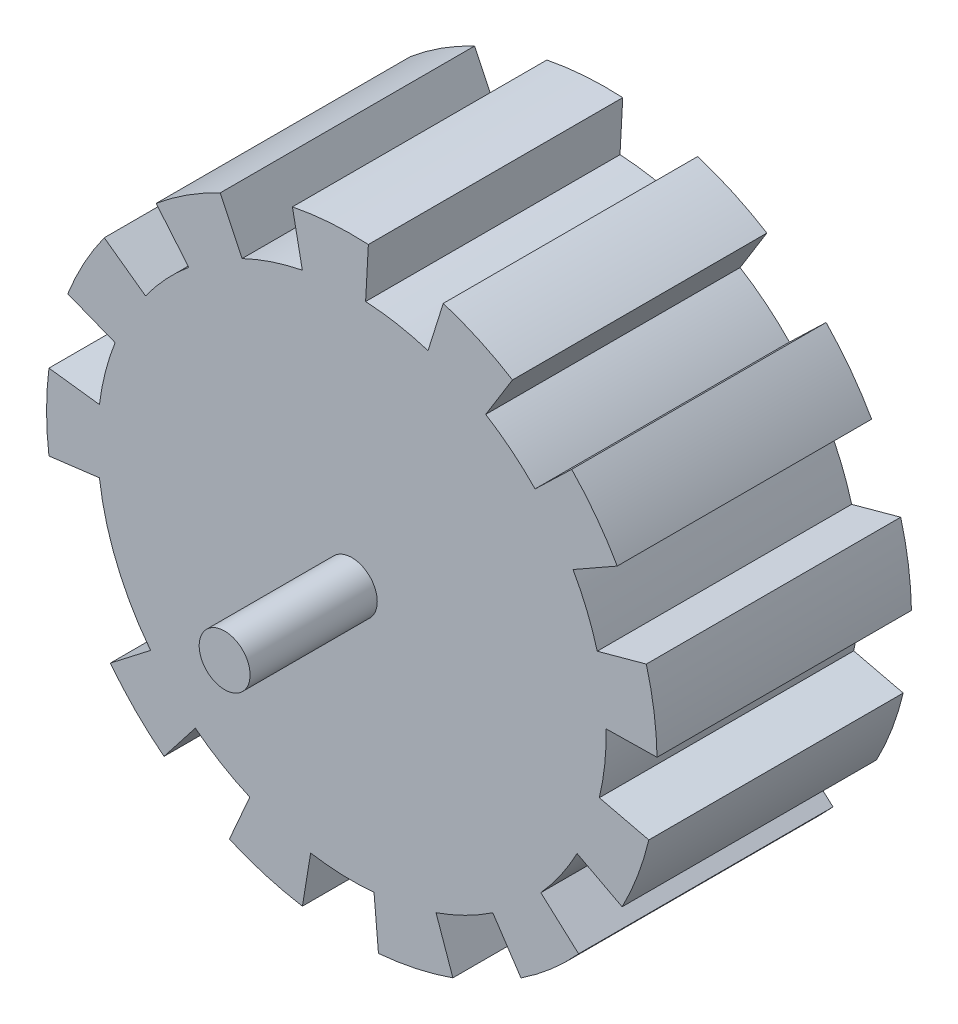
ISO-10303-21;
HEADER;
FILE_DESCRIPTION(('STEP AP214'),'2;1');
FILE_NAME('part.step','',(''),(''),'','','');
FILE_SCHEMA(('AUTOMOTIVE_DESIGN { 1 0 10303 214 1 1 1 1 }'));
ENDSEC;
DATA;
#1=APPLICATION_CONTEXT('core data for automotive mechanical design processes');
#2=APPLICATION_PROTOCOL_DEFINITION('international standard','automotive_design',2000,#1);
#3=PRODUCT_CONTEXT('',#1,'mechanical');
#4=PRODUCT('Part','Part','',(#3));
#5=PRODUCT_RELATED_PRODUCT_CATEGORY('part','',(#4));
#6=PRODUCT_DEFINITION_FORMATION('','',#4);
#7=PRODUCT_DEFINITION_CONTEXT('part definition',#1,'design');
#8=PRODUCT_DEFINITION('design','',#6,#7);
#9=PRODUCT_DEFINITION_SHAPE('','',#8);
#10=(LENGTH_UNIT() NAMED_UNIT(*) SI_UNIT(.MILLI.,.METRE.));
#11=(NAMED_UNIT(*) PLANE_ANGLE_UNIT() SI_UNIT($,.RADIAN.));
#12=(NAMED_UNIT(*) SI_UNIT($,.STERADIAN.) SOLID_ANGLE_UNIT());
#13=UNCERTAINTY_MEASURE_WITH_UNIT(LENGTH_MEASURE(1.E-05),#10,'distance_accuracy_value','');
#14=(GEOMETRIC_REPRESENTATION_CONTEXT(3) GLOBAL_UNCERTAINTY_ASSIGNED_CONTEXT((#13)) GLOBAL_UNIT_ASSIGNED_CONTEXT((#10,
#11,#12)) REPRESENTATION_CONTEXT('',''));
#15=CARTESIAN_POINT('',(0.,0.,0.));
#16=DIRECTION('',(0.,0.,1.));
#17=DIRECTION('',(1.,0.,0.));
#18=AXIS2_PLACEMENT_3D('',#15,#16,#17);
#19=CARTESIAN_POINT('',(0.,0.,12.7));
#20=DIRECTION('',(0.,0.,-1.));
#21=DIRECTION('',(-1.,0.,0.));
#22=AXIS2_PLACEMENT_3D('',#19,#20,#21);
#23=CYLINDRICAL_SURFACE('',#22,12.7);
#24=CARTESIAN_POINT('',(0.,0.,0.));
#25=DIRECTION('',(0.,0.,1.));
#26=DIRECTION('',(1.,0.,0.));
#27=AXIS2_PLACEMENT_3D('',#24,#25,#26);
#28=CIRCLE('',#27,12.7);
#29=CARTESIAN_POINT('',(-12.6009103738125,-1.58336911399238,0.));
#30=VERTEX_POINT('',#29);
#31=CARTESIAN_POINT('',(-10.0470150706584,-7.76836457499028,0.));
#32=VERTEX_POINT('',#31);
#33=EDGE_CURVE('E1180',#30,#32,#28,.T.);
#34=ORIENTED_EDGE('',*,*,#33,.T.);
#35=DIRECTION('',(0.,0.,-1.));
#36=VECTOR('',#35,1.);
#37=CARTESIAN_POINT('',(-10.0470150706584,-7.76836457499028,12.6999999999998));
#38=LINE('',#37,#36);
#39=CARTESIAN_POINT('',(-10.0470150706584,-7.76836457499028,12.7));
#40=VERTEX_POINT('',#39);
#41=EDGE_CURVE('E500',#40,#32,#38,.T.);
#42=ORIENTED_EDGE('',*,*,#41,.F.);
#43=CARTESIAN_POINT('',(0.,0.,12.7));
#44=DIRECTION('',(0.,0.,1.));
#45=DIRECTION('',(1.,0.,0.));
#46=AXIS2_PLACEMENT_3D('',#43,#44,#45);
#47=CIRCLE('',#46,12.7);
#48=CARTESIAN_POINT('',(-12.6009103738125,-1.58336911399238,12.7));
#49=VERTEX_POINT('',#48);
#50=EDGE_CURVE('E484',#49,#40,#47,.T.);
#51=ORIENTED_EDGE('',*,*,#50,.F.);
#52=DIRECTION('',(0.,0.,1.));
#53=VECTOR('',#52,1.);
#54=CARTESIAN_POINT('',(-12.6009103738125,-1.58336911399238,0.));
#55=LINE('',#54,#53);
#56=EDGE_CURVE('E1146',#30,#49,#55,.T.);
#57=ORIENTED_EDGE('',*,*,#56,.F.);
#58=EDGE_LOOP('',(#34,#42,#51,#57));
#59=FACE_BOUND('',#58,.T.);
#60=ADVANCED_FACE('F475',(#59),#23,.T.);
#61=CARTESIAN_POINT('',(-7.81275355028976,-10.0125362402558,12.7));
#62=VERTEX_POINT('',#61);
#63=CARTESIAN_POINT('',(-5.09273285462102,-11.6341768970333,12.7));
#64=VERTEX_POINT('',#63);
#65=EDGE_CURVE('E492',#62,#64,#47,.T.);
#66=ORIENTED_EDGE('',*,*,#65,.F.);
#67=DIRECTION('',(0.,0.,1.));
#68=VECTOR('',#67,1.);
#69=CARTESIAN_POINT('',(-7.81275355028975,-10.0125362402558,-2.39391839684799E-13));
#70=LINE('',#69,#68);
#71=CARTESIAN_POINT('',(-7.81275355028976,-10.0125362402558,0.));
#72=VERTEX_POINT('',#71);
#73=EDGE_CURVE('E822',#72,#62,#70,.T.);
#74=ORIENTED_EDGE('',*,*,#73,.F.);
#75=CARTESIAN_POINT('',(-5.09273285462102,-11.6341768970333,0.));
#76=VERTEX_POINT('',#75);
#77=EDGE_CURVE('E790',#72,#76,#28,.T.);
#78=ORIENTED_EDGE('',*,*,#77,.T.);
#79=DIRECTION('',(0.,0.,-1.));
#80=VECTOR('',#79,1.);
#81=CARTESIAN_POINT('',(-5.09273285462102,-11.6341768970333,12.6999999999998));
#82=LINE('',#81,#80);
#83=EDGE_CURVE('E834',#64,#76,#82,.T.);
#84=ORIENTED_EDGE('',*,*,#83,.F.);
#85=EDGE_LOOP('',(#66,#74,#78,#84));
#86=FACE_BOUND('',#85,.T.);
#87=ADVANCED_FACE('F1219',(#86),#23,.T.);
#88=CARTESIAN_POINT('',(-2.05607069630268,-12.5324607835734,12.7));
#89=VERTEX_POINT('',#88);
#90=CARTESIAN_POINT('',(1.10842797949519,-12.6515369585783,12.7));
#91=VERTEX_POINT('',#90);
#92=EDGE_CURVE('E1826',#89,#91,#47,.T.);
#93=ORIENTED_EDGE('',*,*,#92,.F.);
#94=DIRECTION('',(0.,0.,1.));
#95=VECTOR('',#94,1.);
#96=CARTESIAN_POINT('',(-2.05607069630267,-12.5324607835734,-2.18575157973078E-13));
#97=LINE('',#96,#95);
#98=CARTESIAN_POINT('',(-2.05607069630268,-12.5324607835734,0.));
#99=VERTEX_POINT('',#98);
#100=EDGE_CURVE('E827',#99,#89,#97,.T.);
#101=ORIENTED_EDGE('',*,*,#100,.F.);
#102=CARTESIAN_POINT('',(1.10842797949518,-12.6515369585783,0.));
#103=VERTEX_POINT('',#102);
#104=EDGE_CURVE('E1185',#99,#103,#28,.T.);
#105=ORIENTED_EDGE('',*,*,#104,.T.);
#106=DIRECTION('',(0.,0.,-1.));
#107=VECTOR('',#106,1.);
#108=CARTESIAN_POINT('',(1.10842797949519,-12.6515369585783,12.6999999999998));
#109=LINE('',#108,#107);
#110=EDGE_CURVE('E865',#91,#103,#109,.T.);
#111=ORIENTED_EDGE('',*,*,#110,.F.);
#112=EDGE_LOOP('',(#93,#101,#105,#111));
#113=FACE_BOUND('',#112,.T.);
#114=ADVANCED_FACE('F1223',(#113),#23,.T.);
#115=CARTESIAN_POINT('',(4.20400997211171,-11.9840018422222,12.7));
#116=VERTEX_POINT('',#115);
#117=CARTESIAN_POINT('',(7.03820698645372,-10.5713595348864,12.7));
#118=VERTEX_POINT('',#117);
#119=EDGE_CURVE('E1830',#116,#118,#47,.T.);
#120=ORIENTED_EDGE('',*,*,#119,.F.);
#121=DIRECTION('',(0.,0.,1.));
#122=VECTOR('',#121,1.);
#123=CARTESIAN_POINT('',(4.20400997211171,-11.9840018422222,-1.96023752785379E-13));
#124=LINE('',#123,#122);
#125=CARTESIAN_POINT('',(4.20400997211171,-11.9840018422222,0.));
#126=VERTEX_POINT('',#125);
#127=EDGE_CURVE('E858',#126,#116,#124,.T.);
#128=ORIENTED_EDGE('',*,*,#127,.F.);
#129=CARTESIAN_POINT('',(7.03820698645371,-10.5713595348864,0.));
#130=VERTEX_POINT('',#129);
#131=EDGE_CURVE('E1836',#126,#130,#28,.T.);
#132=ORIENTED_EDGE('',*,*,#131,.T.);
#133=DIRECTION('',(0.,0.,-1.));
#134=VECTOR('',#133,1.);
#135=CARTESIAN_POINT('',(7.03820698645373,-10.5713595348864,12.6999999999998));
#136=LINE('',#135,#134);
#137=EDGE_CURVE('E897',#118,#130,#136,.T.);
#138=ORIENTED_EDGE('',*,*,#137,.F.);
#139=EDGE_LOOP('',(#120,#128,#132,#138));
#140=FACE_BOUND('',#139,.T.);
#141=ADVANCED_FACE('F1713',(#140),#23,.T.);
#142=CARTESIAN_POINT('',(9.4348023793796,-8.50144129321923,12.7));
#143=VERTEX_POINT('',#142);
#144=CARTESIAN_POINT('',(11.2447874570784,-5.90294460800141,12.7));
#145=VERTEX_POINT('',#144);
#146=EDGE_CURVE('E1902',#143,#145,#47,.T.);
#147=ORIENTED_EDGE('',*,*,#146,.F.);
#148=DIRECTION('',(0.,0.,1.));
#149=VECTOR('',#148,1.);
#150=CARTESIAN_POINT('',(9.4348023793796,-8.50144129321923,-1.73472347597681E-13));
#151=LINE('',#150,#149);
#152=CARTESIAN_POINT('',(9.43480237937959,-8.50144129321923,0.));
#153=VERTEX_POINT('',#152);
#154=EDGE_CURVE('E890',#153,#143,#151,.T.);
#155=ORIENTED_EDGE('',*,*,#154,.F.);
#156=CARTESIAN_POINT('',(11.2447874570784,-5.90294460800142,0.));
#157=VERTEX_POINT('',#156);
#158=EDGE_CURVE('E1837',#153,#157,#28,.T.);
#159=ORIENTED_EDGE('',*,*,#158,.T.);
#160=DIRECTION('',(0.,0.,-1.));
#161=VECTOR('',#160,1.);
#162=CARTESIAN_POINT('',(11.2447874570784,-5.90294460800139,12.6999999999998));
#163=LINE('',#162,#161);
#164=EDGE_CURVE('E929',#145,#157,#163,.T.);
#165=ORIENTED_EDGE('',*,*,#164,.F.);
#166=EDGE_LOOP('',(#147,#155,#159,#165));
#167=FACE_BOUND('',#166,.T.);
#168=ADVANCED_FACE('F1704',(#167),#23,.T.);
#169=CARTESIAN_POINT('',(12.355626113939,-2.93743141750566,12.7));
#170=VERTEX_POINT('',#169);
#171=CARTESIAN_POINT('',(12.6982517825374,0.210717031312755,12.7));
#172=VERTEX_POINT('',#171);
#173=EDGE_CURVE('E1854',#170,#172,#47,.T.);
#174=ORIENTED_EDGE('',*,*,#173,.F.);
#175=DIRECTION('',(0.,0.,1.));
#176=VECTOR('',#175,1.);
#177=CARTESIAN_POINT('',(12.355626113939,-2.93743141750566,-1.52655665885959E-13));
#178=LINE('',#177,#176);
#179=CARTESIAN_POINT('',(12.355626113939,-2.93743141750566,0.));
#180=VERTEX_POINT('',#179);
#181=EDGE_CURVE('E922',#180,#170,#178,.T.);
#182=ORIENTED_EDGE('',*,*,#181,.F.);
#183=CARTESIAN_POINT('',(12.6982517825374,0.210717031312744,0.));
#184=VERTEX_POINT('',#183);
#185=EDGE_CURVE('E1192',#180,#184,#28,.T.);
#186=ORIENTED_EDGE('',*,*,#185,.T.);
#187=DIRECTION('',(0.,0.,-1.));
#188=VECTOR('',#187,1.);
#189=CARTESIAN_POINT('',(12.6982517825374,0.210717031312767,12.6999999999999));
#190=LINE('',#189,#188);
#191=EDGE_CURVE('E961',#172,#184,#190,.T.);
#192=ORIENTED_EDGE('',*,*,#191,.F.);
#193=EDGE_LOOP('',(#174,#182,#186,#192));
#194=FACE_BOUND('',#193,.T.);
#195=ADVANCED_FACE('F1696',(#194),#23,.T.);
#196=CARTESIAN_POINT('',(9.14753658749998,8.80979990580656,0.));
#197=VERTEX_POINT('',#196);
#198=CARTESIAN_POINT('',(6.68358245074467,10.7990613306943,0.));
#199=VERTEX_POINT('',#198);
#200=EDGE_CURVE('E1182',#197,#199,#28,.T.);
#201=ORIENTED_EDGE('',*,*,#200,.T.);
#202=DIRECTION('',(0.,0.,-1.));
#203=VECTOR('',#202,1.);
#204=CARTESIAN_POINT('',(6.68358245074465,10.7990613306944,12.6999999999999));
#205=LINE('',#204,#203);
#206=CARTESIAN_POINT('',(6.68358245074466,10.7990613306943,12.7));
#207=VERTEX_POINT('',#206);
#208=EDGE_CURVE('E993',#207,#199,#205,.T.);
#209=ORIENTED_EDGE('',*,*,#208,.F.);
#210=CARTESIAN_POINT('',(9.14753658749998,8.80979990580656,12.7));
#211=VERTEX_POINT('',#210);
#212=EDGE_CURVE('E1179',#211,#207,#47,.T.);
#213=ORIENTED_EDGE('',*,*,#212,.F.);
#214=DIRECTION('',(0.,0.,1.));
#215=VECTOR('',#214,1.);
#216=CARTESIAN_POINT('',(9.14753658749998,8.80979990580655,-1.09287578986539E-13));
#217=LINE('',#216,#215);
#218=EDGE_CURVE('E1114',#197,#211,#217,.T.);
#219=ORIENTED_EDGE('',*,*,#218,.F.);
#220=EDGE_LOOP('',(#201,#209,#213,#219));
#221=FACE_BOUND('',#220,.T.);
#222=ADVANCED_FACE('F1687',(#221),#23,.T.);
#223=CARTESIAN_POINT('',(3.80407552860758,12.1168894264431,12.7));
#224=VERTEX_POINT('',#223);
#225=CARTESIAN_POINT('',(0.688049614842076,12.6813480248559,12.7));
#226=VERTEX_POINT('',#225);
#227=EDGE_CURVE('E1862',#224,#226,#47,.T.);
#228=ORIENTED_EDGE('',*,*,#227,.F.);
#229=DIRECTION('',(0.,0.,1.));
#230=VECTOR('',#229,1.);
#231=CARTESIAN_POINT('',(3.80407552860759,12.1168894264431,0.));
#232=LINE('',#231,#230);
#233=CARTESIAN_POINT('',(3.80407552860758,12.1168894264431,0.));
#234=VERTEX_POINT('',#233);
#235=EDGE_CURVE('E986',#234,#224,#232,.T.);
#236=ORIENTED_EDGE('',*,*,#235,.F.);
#237=CARTESIAN_POINT('',(0.688049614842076,12.6813480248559,0.));
#238=VERTEX_POINT('',#237);
#239=EDGE_CURVE('E1187',#234,#238,#28,.T.);
#240=ORIENTED_EDGE('',*,*,#239,.T.);
#241=DIRECTION('',(0.,0.,-1.));
#242=VECTOR('',#241,1.);
#243=CARTESIAN_POINT('',(0.688049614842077,12.6813480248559,12.6999999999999));
#244=LINE('',#243,#242);
#245=EDGE_CURVE('E1025',#226,#238,#244,.T.);
#246=ORIENTED_EDGE('',*,*,#245,.F.);
#247=EDGE_LOOP('',(#228,#236,#240,#246));
#248=FACE_BOUND('',#247,.T.);
#249=ADVANCED_FACE('F1678',(#248),#23,.T.);
#250=CARTESIAN_POINT('',(-2.47075589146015,12.4573418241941,12.7));
#251=VERTEX_POINT('',#250);
#252=CARTESIAN_POINT('',(-5.47594176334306,11.4587984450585,12.7));
#253=VERTEX_POINT('',#252);
#254=EDGE_CURVE('E1871',#251,#253,#47,.T.);
#255=ORIENTED_EDGE('',*,*,#254,.F.);
#256=DIRECTION('',(0.,0.,1.));
#257=VECTOR('',#256,1.);
#258=CARTESIAN_POINT('',(-2.47075589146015,12.4573418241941,0.));
#259=LINE('',#258,#257);
#260=CARTESIAN_POINT('',(-2.47075589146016,12.4573418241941,0.));
#261=VERTEX_POINT('',#260);
#262=EDGE_CURVE('E1018',#261,#251,#259,.T.);
#263=ORIENTED_EDGE('',*,*,#262,.F.);
#264=CARTESIAN_POINT('',(-5.47594176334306,11.4587984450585,0.));
#265=VERTEX_POINT('',#264);
#266=EDGE_CURVE('E1193',#261,#265,#28,.T.);
#267=ORIENTED_EDGE('',*,*,#266,.T.);
#268=DIRECTION('',(0.,0.,-1.));
#269=VECTOR('',#268,1.);
#270=CARTESIAN_POINT('',(-5.47594176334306,11.4587984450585,12.7));
#271=LINE('',#270,#269);
#272=EDGE_CURVE('E1057',#253,#265,#271,.T.);
#273=ORIENTED_EDGE('',*,*,#272,.F.);
#274=EDGE_LOOP('',(#255,#263,#267,#273));
#275=FACE_BOUND('',#274,.T.);
#276=ADVANCED_FACE('F1669',(#275),#23,.T.);
#277=CARTESIAN_POINT('',(-8.14066009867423,9.74780247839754,12.7));
#278=VERTEX_POINT('',#277);
#279=CARTESIAN_POINT('',(-10.2992316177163,7.43073536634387,12.7));
#280=VERTEX_POINT('',#279);
#281=EDGE_CURVE('E1184',#278,#280,#47,.T.);
#282=ORIENTED_EDGE('',*,*,#281,.F.);
#283=DIRECTION('',(0.,0.,1.));
#284=VECTOR('',#283,1.);
#285=CARTESIAN_POINT('',(-8.14066009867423,9.74780247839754,0.));
#286=LINE('',#285,#284);
#287=CARTESIAN_POINT('',(-8.14066009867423,9.74780247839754,0.));
#288=VERTEX_POINT('',#287);
#289=EDGE_CURVE('E1050',#288,#278,#286,.T.);
#290=ORIENTED_EDGE('',*,*,#289,.F.);
#291=CARTESIAN_POINT('',(-10.2992316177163,7.43073536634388,0.));
#292=VERTEX_POINT('',#291);
#293=EDGE_CURVE('E1194',#288,#292,#28,.T.);
#294=ORIENTED_EDGE('',*,*,#293,.T.);
#295=DIRECTION('',(0.,0.,-1.));
#296=VECTOR('',#295,1.);
#297=CARTESIAN_POINT('',(-10.2992316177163,7.43073536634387,12.7));
#298=LINE('',#297,#296);
#299=EDGE_CURVE('E1089',#280,#292,#298,.T.);
#300=ORIENTED_EDGE('',*,*,#299,.F.);
#301=EDGE_LOOP('',(#282,#290,#294,#300));
#302=FACE_BOUND('',#301,.T.);
#303=ADVANCED_FACE('F1232',(#302),#23,.T.);
#304=CARTESIAN_POINT('',(12.2513616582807,3.34576411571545,12.7));
#305=VERTEX_POINT('',#304);
#306=CARTESIAN_POINT('',(11.042741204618,6.27278779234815,12.7));
#307=VERTEX_POINT('',#306);
#308=EDGE_CURVE('E1858',#305,#307,#47,.T.);
#309=ORIENTED_EDGE('',*,*,#308,.F.);
#310=DIRECTION('',(0.,0.,1.));
#311=VECTOR('',#310,1.);
#312=CARTESIAN_POINT('',(12.2513616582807,3.34576411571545,-1.30104260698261E-13));
#313=LINE('',#312,#311);
#314=CARTESIAN_POINT('',(12.2513616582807,3.34576411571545,0.));
#315=VERTEX_POINT('',#314);
#316=EDGE_CURVE('E954',#315,#305,#313,.T.);
#317=ORIENTED_EDGE('',*,*,#316,.F.);
#318=CARTESIAN_POINT('',(11.042741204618,6.27278779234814,0.));
#319=VERTEX_POINT('',#318);
#320=EDGE_CURVE('E1186',#315,#319,#28,.T.);
#321=ORIENTED_EDGE('',*,*,#320,.T.);
#322=DIRECTION('',(0.,0.,-1.));
#323=VECTOR('',#322,1.);
#324=CARTESIAN_POINT('',(11.042741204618,6.27278779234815,12.6999999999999));
#325=LINE('',#324,#323);
#326=EDGE_CURVE('E1121',#307,#319,#325,.T.);
#327=ORIENTED_EDGE('',*,*,#326,.F.);
#328=EDGE_LOOP('',(#309,#317,#321,#327));
#329=FACE_BOUND('',#328,.T.);
#330=ADVANCED_FACE('F1226',(#329),#23,.T.);
#331=CARTESIAN_POINT('',(-11.8174467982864,4.65166111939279,12.7));
#332=VERTEX_POINT('',#331);
#333=CARTESIAN_POINT('',(-12.6009103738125,1.58336911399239,12.7));
#334=VERTEX_POINT('',#333);
#335=EDGE_CURVE('E1181',#332,#334,#47,.T.);
#336=ORIENTED_EDGE('',*,*,#335,.F.);
#337=DIRECTION('',(0.,0.,1.));
#338=VECTOR('',#337,1.);
#339=CARTESIAN_POINT('',(-11.8174467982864,4.6516611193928,0.));
#340=LINE('',#339,#338);
#341=CARTESIAN_POINT('',(-11.8174467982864,4.6516611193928,0.));
#342=VERTEX_POINT('',#341);
#343=EDGE_CURVE('E1082',#342,#332,#340,.T.);
#344=ORIENTED_EDGE('',*,*,#343,.F.);
#345=CARTESIAN_POINT('',(-12.6009103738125,1.58336911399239,0.));
#346=VERTEX_POINT('',#345);
#347=EDGE_CURVE('E1188',#342,#346,#28,.T.);
#348=ORIENTED_EDGE('',*,*,#347,.T.);
#349=DIRECTION('',(0.,0.,-1.));
#350=VECTOR('',#349,1.);
#351=CARTESIAN_POINT('',(-12.6009103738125,1.58336911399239,12.7));
#352=LINE('',#351,#350);
#353=EDGE_CURVE('E1152',#334,#346,#352,.T.);
#354=ORIENTED_EDGE('',*,*,#353,.F.);
#355=EDGE_LOOP('',(#336,#344,#348,#354));
#356=FACE_BOUND('',#355,.T.);
#357=ADVANCED_FACE('F477',(#356),#23,.T.);
#358=CARTESIAN_POINT('',(0.,0.,12.7));
#359=DIRECTION('',(0.,0.,1.));
#360=DIRECTION('',(1.,0.,0.));
#361=AXIS2_PLACEMENT_3D('',#358,#359,#360);
#362=PLANE('',#361);
#363=CARTESIAN_POINT('',(0.,0.,12.7));
#364=DIRECTION('',(0.,0.,1.));
#365=DIRECTION('',(1.,0.,0.));
#366=AXIS2_PLACEMENT_3D('',#363,#364,#365);
#367=CIRCLE('',#366,1.27);
#368=CARTESIAN_POINT('',(1.27,0.,12.7));
#369=VERTEX_POINT('',#368);
#370=EDGE_CURVE('E13',#369,#369,#367,.T.);
#371=ORIENTED_EDGE('',*,*,#370,.F.);
#372=EDGE_LOOP('',(#371));
#373=FACE_BOUND('',#372,.T.);
#374=ORIENTED_EDGE('',*,*,#50,.T.);
#375=DIRECTION('',(-0.791103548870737,-0.611682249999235,0.));
#376=VECTOR('',#375,1.);
#377=CARTESIAN_POINT('',(-10.0470150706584,-7.76836457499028,12.7));
#378=LINE('',#377,#376);
#379=CARTESIAN_POINT('',(-12.05641808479,-9.32203748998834,12.7));
#380=VERTEX_POINT('',#379);
#381=EDGE_CURVE('E826',#40,#380,#378,.T.);
#382=ORIENTED_EDGE('',*,*,#381,.T.);
#383=CARTESIAN_POINT('',(0.,0.,12.7));
#384=DIRECTION('',(0.,0.,-1.));
#385=DIRECTION('',(-1.,0.,0.));
#386=AXIS2_PLACEMENT_3D('',#383,#384,#385);
#387=CIRCLE('',#386,15.24);
#388=CARTESIAN_POINT('',(-9.37530426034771,-12.0150434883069,12.7));
#389=VERTEX_POINT('',#388);
#390=EDGE_CURVE('E803',#380,#389,#387,.F.);
#391=ORIENTED_EDGE('',*,*,#390,.T.);
#392=DIRECTION('',(-0.615177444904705,-0.788388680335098,0.));
#393=VECTOR('',#392,1.);
#394=CARTESIAN_POINT('',(-7.81275355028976,-10.0125362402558,12.7));
#395=LINE('',#394,#393);
#396=EDGE_CURVE('E794',#62,#389,#395,.T.);
#397=ORIENTED_EDGE('',*,*,#396,.F.);
#398=ORIENTED_EDGE('',*,*,#65,.T.);
#399=DIRECTION('',(-0.401002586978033,-0.916076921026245,0.));
#400=VECTOR('',#399,1.);
#401=CARTESIAN_POINT('',(-5.09273285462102,-11.6341768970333,12.7));
#402=LINE('',#401,#400);
#403=CARTESIAN_POINT('',(-6.11127942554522,-13.96101227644,12.7));
#404=VERTEX_POINT('',#403);
#405=EDGE_CURVE('E856',#64,#404,#402,.T.);
#406=ORIENTED_EDGE('',*,*,#405,.T.);
#407=CARTESIAN_POINT('',(0.,0.,12.7));
#408=DIRECTION('',(0.,0.,-1.));
#409=DIRECTION('',(-1.,0.,0.));
#410=AXIS2_PLACEMENT_3D('',#407,#408,#409);
#411=CIRCLE('',#410,15.24);
#412=CARTESIAN_POINT('',(-2.46728483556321,-15.0389529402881,12.7));
#413=VERTEX_POINT('',#412);
#414=EDGE_CURVE('E833',#404,#413,#411,.F.);
#415=ORIENTED_EDGE('',*,*,#414,.T.);
#416=DIRECTION('',(-0.161895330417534,-0.986807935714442,0.));
#417=VECTOR('',#416,1.);
#418=CARTESIAN_POINT('',(-2.05607069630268,-12.5324607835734,12.7));
#419=LINE('',#418,#417);
#420=EDGE_CURVE('E839',#89,#413,#419,.T.);
#421=ORIENTED_EDGE('',*,*,#420,.F.);
#422=ORIENTED_EDGE('',*,*,#92,.T.);
#423=DIRECTION('',(0.0872777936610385,-0.996184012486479,0.));
#424=VECTOR('',#423,1.);
#425=CARTESIAN_POINT('',(1.10842797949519,-12.6515369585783,12.7));
#426=LINE('',#425,#424);
#427=CARTESIAN_POINT('',(1.33011357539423,-15.1818443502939,12.7));
#428=VERTEX_POINT('',#427);
#429=EDGE_CURVE('E888',#91,#428,#426,.T.);
#430=ORIENTED_EDGE('',*,*,#429,.T.);
#431=CARTESIAN_POINT('',(0.,0.,12.7));
#432=DIRECTION('',(0.,0.,-1.));
#433=DIRECTION('',(-1.,0.,0.));
#434=AXIS2_PLACEMENT_3D('',#431,#432,#433);
#435=CIRCLE('',#434,15.24);
#436=CARTESIAN_POINT('',(5.04481196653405,-14.3808022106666,12.7));
#437=VERTEX_POINT('',#436);
#438=EDGE_CURVE('E864',#428,#437,#435,.F.);
#439=ORIENTED_EDGE('',*,*,#438,.T.);
#440=DIRECTION('',(0.33102440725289,-0.943622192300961,0.));
#441=VECTOR('',#440,1.);
#442=CARTESIAN_POINT('',(4.20400997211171,-11.9840018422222,12.7));
#443=LINE('',#442,#441);
#444=EDGE_CURVE('E870',#116,#437,#443,.T.);
#445=ORIENTED_EDGE('',*,*,#444,.F.);
#446=ORIENTED_EDGE('',*,*,#119,.T.);
#447=DIRECTION('',(0.55418952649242,-0.832390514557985,0.));
#448=VECTOR('',#447,1.);
#449=CARTESIAN_POINT('',(7.03820698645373,-10.5713595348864,12.7));
#450=LINE('',#449,#448);
#451=CARTESIAN_POINT('',(8.44584838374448,-12.6856314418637,12.7));
#452=VERTEX_POINT('',#451);
#453=EDGE_CURVE('E920',#118,#452,#450,.T.);
#454=ORIENTED_EDGE('',*,*,#453,.T.);
#455=CARTESIAN_POINT('',(0.,0.,12.7));
#456=DIRECTION('',(0.,0.,-1.));
#457=DIRECTION('',(-1.,0.,0.));
#458=AXIS2_PLACEMENT_3D('',#455,#456,#457);
#459=CIRCLE('',#458,15.24);
#460=CARTESIAN_POINT('',(11.3217628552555,-10.2017295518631,12.7));
#461=VERTEX_POINT('',#460);
#462=EDGE_CURVE('E896',#452,#461,#459,.F.);
#463=ORIENTED_EDGE('',*,*,#462,.T.);
#464=DIRECTION('',(0.742897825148,-0.669404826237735,0.));
#465=VECTOR('',#464,1.);
#466=CARTESIAN_POINT('',(9.43480237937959,-8.50144129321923,12.7));
#467=LINE('',#466,#465);
#468=EDGE_CURVE('E902',#143,#461,#467,.T.);
#469=ORIENTED_EDGE('',*,*,#468,.F.);
#470=ORIENTED_EDGE('',*,*,#146,.T.);
#471=DIRECTION('',(0.885416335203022,-0.464798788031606,0.));
#472=VECTOR('',#471,1.);
#473=CARTESIAN_POINT('',(11.2447874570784,-5.90294460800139,12.7));
#474=LINE('',#473,#472);
#475=CARTESIAN_POINT('',(13.4937449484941,-7.08353352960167,12.7));
#476=VERTEX_POINT('',#475);
#477=EDGE_CURVE('E952',#145,#476,#474,.T.);
#478=ORIENTED_EDGE('',*,*,#477,.T.);
#479=CARTESIAN_POINT('',(0.,0.,12.7));
#480=DIRECTION('',(0.,0.,-1.));
#481=DIRECTION('',(-1.,0.,0.));
#482=AXIS2_PLACEMENT_3D('',#479,#480,#481);
#483=CIRCLE('',#482,15.24);
#484=CARTESIAN_POINT('',(14.8267513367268,-3.52491770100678,12.7));
#485=VERTEX_POINT('',#484);
#486=EDGE_CURVE('E928',#476,#485,#483,.F.);
#487=ORIENTED_EDGE('',*,*,#486,.T.);
#488=DIRECTION('',(0.972883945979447,-0.23129381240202,0.));
#489=VECTOR('',#488,1.);
#490=CARTESIAN_POINT('',(12.355626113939,-2.93743141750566,12.7));
#491=LINE('',#490,#489);
#492=EDGE_CURVE('E934',#170,#485,#491,.T.);
#493=ORIENTED_EDGE('',*,*,#492,.F.);
#494=ORIENTED_EDGE('',*,*,#173,.T.);
#495=DIRECTION('',(0.999862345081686,0.0165918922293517,0.));
#496=VECTOR('',#495,1.);
#497=CARTESIAN_POINT('',(12.6982517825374,0.210717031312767,12.7));
#498=LINE('',#497,#496);
#499=CARTESIAN_POINT('',(15.2379021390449,0.252860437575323,12.7));
#500=VERTEX_POINT('',#499);
#501=EDGE_CURVE('E984',#172,#500,#498,.T.);
#502=ORIENTED_EDGE('',*,*,#501,.T.);
#503=CARTESIAN_POINT('',(0.,0.,12.7));
#504=DIRECTION('',(0.,0.,-1.));
#505=DIRECTION('',(-1.,0.,0.));
#506=AXIS2_PLACEMENT_3D('',#503,#504,#505);
#507=CIRCLE('',#506,15.24);
#508=CARTESIAN_POINT('',(14.7016339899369,4.01491693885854,12.7));
#509=VERTEX_POINT('',#508);
#510=EDGE_CURVE('E960',#500,#509,#507,.F.);
#511=ORIENTED_EDGE('',*,*,#510,.T.);
#512=DIRECTION('',(0.964674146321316,0.263445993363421,0.));
#513=VECTOR('',#512,1.);
#514=CARTESIAN_POINT('',(12.2513616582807,3.34576411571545,12.7));
#515=LINE('',#514,#513);
#516=EDGE_CURVE('E966',#305,#509,#515,.T.);
#517=ORIENTED_EDGE('',*,*,#516,.F.);
#518=ORIENTED_EDGE('',*,*,#308,.T.);
#519=DIRECTION('',(0.869507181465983,0.493920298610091,0.));
#520=VECTOR('',#519,1.);
#521=CARTESIAN_POINT('',(11.042741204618,6.27278779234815,12.7));
#522=LINE('',#521,#520);
#523=CARTESIAN_POINT('',(13.2512894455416,7.52734535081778,12.7));
#524=VERTEX_POINT('',#523);
#525=EDGE_CURVE('E1144',#307,#524,#522,.T.);
#526=ORIENTED_EDGE('',*,*,#525,.T.);
#527=CARTESIAN_POINT('',(0.,0.,12.7));
#528=DIRECTION('',(0.,0.,-1.));
#529=DIRECTION('',(-1.,0.,0.));
#530=AXIS2_PLACEMENT_3D('',#527,#528,#529);
#531=CIRCLE('',#530,15.24);
#532=CARTESIAN_POINT('',(10.977043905,10.5717598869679,12.7));
#533=VERTEX_POINT('',#532);
#534=EDGE_CURVE('E1120',#524,#533,#531,.F.);
#535=ORIENTED_EDGE('',*,*,#534,.T.);
#536=DIRECTION('',(0.720278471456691,0.693685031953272,0.));
#537=VECTOR('',#536,1.);
#538=CARTESIAN_POINT('',(9.14753658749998,8.80979990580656,12.7));
#539=LINE('',#538,#537);
#540=EDGE_CURVE('E1126',#211,#533,#539,.T.);
#541=ORIENTED_EDGE('',*,*,#540,.F.);
#542=ORIENTED_EDGE('',*,*,#212,.T.);
#543=DIRECTION('',(0.526266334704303,0.850319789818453,0.));
#544=VECTOR('',#543,1.);
#545=CARTESIAN_POINT('',(6.68358245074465,10.7990613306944,12.7));
#546=LINE('',#545,#544);
#547=CARTESIAN_POINT('',(8.02029894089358,12.9588735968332,12.7));
#548=VERTEX_POINT('',#547);
#549=EDGE_CURVE('E1016',#207,#548,#546,.T.);
#550=ORIENTED_EDGE('',*,*,#549,.T.);
#551=CARTESIAN_POINT('',(0.,0.,12.7));
#552=DIRECTION('',(0.,0.,-1.));
#553=DIRECTION('',(-1.,0.,0.));
#554=AXIS2_PLACEMENT_3D('',#551,#552,#553);
#555=CIRCLE('',#554,15.24);
#556=CARTESIAN_POINT('',(4.56489063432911,14.5402673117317,12.7));
#557=VERTEX_POINT('',#556);
#558=EDGE_CURVE('E992',#548,#557,#555,.F.);
#559=ORIENTED_EDGE('',*,*,#558,.T.);
#560=DIRECTION('',(0.299533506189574,0.954085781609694,0.));
#561=VECTOR('',#560,1.);
#562=CARTESIAN_POINT('',(3.80407552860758,12.1168894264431,12.7));
#563=LINE('',#562,#561);
#564=EDGE_CURVE('E998',#224,#557,#563,.T.);
#565=ORIENTED_EDGE('',*,*,#564,.F.);
#566=ORIENTED_EDGE('',*,*,#227,.T.);
#567=DIRECTION('',(0.0541771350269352,0.998531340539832,0.));
#568=VECTOR('',#567,1.);
#569=CARTESIAN_POINT('',(0.688049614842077,12.6813480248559,12.7));
#570=LINE('',#569,#568);
#571=CARTESIAN_POINT('',(0.825659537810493,15.217617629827,12.7));
#572=VERTEX_POINT('',#571);
#573=EDGE_CURVE('E1048',#226,#572,#570,.T.);
#574=ORIENTED_EDGE('',*,*,#573,.T.);
#575=CARTESIAN_POINT('',(0.,0.,12.7));
#576=DIRECTION('',(0.,0.,-1.));
#577=DIRECTION('',(-1.,0.,0.));
#578=AXIS2_PLACEMENT_3D('',#575,#576,#577);
#579=CIRCLE('',#578,15.24);
#580=CARTESIAN_POINT('',(-2.96490706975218,14.9488101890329,12.7));
#581=VERTEX_POINT('',#580);
#582=EDGE_CURVE('E1024',#572,#581,#579,.F.);
#583=ORIENTED_EDGE('',*,*,#582,.T.);
#584=DIRECTION('',(-0.194547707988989,0.980893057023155,0.));
#585=VECTOR('',#584,1.);
#586=CARTESIAN_POINT('',(-2.47075589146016,12.4573418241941,12.7));
#587=LINE('',#586,#585);
#588=EDGE_CURVE('E1030',#251,#581,#587,.T.);
#589=ORIENTED_EDGE('',*,*,#588,.F.);
#590=ORIENTED_EDGE('',*,*,#254,.T.);
#591=DIRECTION('',(-0.431176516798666,0.902267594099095,0.));
#592=VECTOR('',#591,1.);
#593=CARTESIAN_POINT('',(-5.47594176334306,11.4587984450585,12.7));
#594=LINE('',#593,#592);
#595=CARTESIAN_POINT('',(-6.57113011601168,13.7505581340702,12.7));
#596=VERTEX_POINT('',#595);
#597=EDGE_CURVE('E1080',#253,#596,#594,.T.);
#598=ORIENTED_EDGE('',*,*,#597,.T.);
#599=CARTESIAN_POINT('',(0.,0.,12.7));
#600=DIRECTION('',(0.,0.,-1.));
#601=DIRECTION('',(-1.,0.,0.));
#602=AXIS2_PLACEMENT_3D('',#599,#600,#601);
#603=CIRCLE('',#602,15.24);
#604=CARTESIAN_POINT('',(-9.76879211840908,11.697362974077,12.7));
#605=VERTEX_POINT('',#604);
#606=EDGE_CURVE('E1056',#596,#605,#603,.F.);
#607=ORIENTED_EDGE('',*,*,#606,.T.);
#608=DIRECTION('',(-0.640996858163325,0.767543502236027,0.));
#609=VECTOR('',#608,1.);
#610=CARTESIAN_POINT('',(-8.14066009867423,9.74780247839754,12.7));
#611=LINE('',#610,#609);
#612=EDGE_CURVE('E1062',#278,#605,#611,.T.);
#613=ORIENTED_EDGE('',*,*,#612,.F.);
#614=ORIENTED_EDGE('',*,*,#281,.T.);
#615=DIRECTION('',(-0.810963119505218,0.585097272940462,0.));
#616=VECTOR('',#615,1.);
#617=CARTESIAN_POINT('',(-10.2992316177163,7.43073536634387,12.7));
#618=LINE('',#617,#616);
#619=CARTESIAN_POINT('',(-12.3590779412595,8.91688243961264,12.7));
#620=VERTEX_POINT('',#619);
#621=EDGE_CURVE('E1112',#280,#620,#618,.T.);
#622=ORIENTED_EDGE('',*,*,#621,.T.);
#623=CARTESIAN_POINT('',(0.,0.,12.7));
#624=DIRECTION('',(0.,0.,-1.));
#625=DIRECTION('',(-1.,0.,0.));
#626=AXIS2_PLACEMENT_3D('',#623,#624,#625);
#627=CIRCLE('',#626,15.24);
#628=CARTESIAN_POINT('',(-14.1809361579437,5.58199334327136,12.7));
#629=VERTEX_POINT('',#628);
#630=EDGE_CURVE('E1088',#620,#629,#627,.F.);
#631=ORIENTED_EDGE('',*,*,#630,.T.);
#632=DIRECTION('',(-0.930507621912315,0.366272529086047,0.));
#633=VECTOR('',#632,1.);
#634=CARTESIAN_POINT('',(-11.8174467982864,4.6516611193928,12.7));
#635=LINE('',#634,#633);
#636=EDGE_CURVE('E1094',#332,#629,#635,.T.);
#637=ORIENTED_EDGE('',*,*,#636,.F.);
#638=ORIENTED_EDGE('',*,*,#335,.T.);
#639=DIRECTION('',(-0.992197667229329,0.124674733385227,0.));
#640=VECTOR('',#639,1.);
#641=CARTESIAN_POINT('',(-12.6009103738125,1.58336911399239,12.7));
#642=LINE('',#641,#640);
#643=CARTESIAN_POINT('',(-15.121092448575,1.90004293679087,12.7));
#644=VERTEX_POINT('',#643);
#645=EDGE_CURVE('E1168',#334,#644,#642,.T.);
#646=ORIENTED_EDGE('',*,*,#645,.T.);
#647=CARTESIAN_POINT('',(0.,0.,12.7));
#648=DIRECTION('',(0.,0.,-1.));
#649=DIRECTION('',(-1.,0.,0.));
#650=AXIS2_PLACEMENT_3D('',#647,#648,#649);
#651=CIRCLE('',#650,15.24);
#652=CARTESIAN_POINT('',(-15.121092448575,-1.90004293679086,12.7));
#653=VERTEX_POINT('',#652);
#654=EDGE_CURVE('E1157',#644,#653,#651,.F.);
#655=ORIENTED_EDGE('',*,*,#654,.T.);
#656=DIRECTION('',(-0.992197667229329,-0.124674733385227,0.));
#657=VECTOR('',#656,1.);
#658=CARTESIAN_POINT('',(-12.6009103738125,-1.58336911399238,12.7));
#659=LINE('',#658,#657);
#660=EDGE_CURVE('E1170',#49,#653,#659,.T.);
#661=ORIENTED_EDGE('',*,*,#660,.F.);
#662=EDGE_LOOP('',(#374,#382,#391,#397,#398,#406,#415,#421,#422,#430,#439,#445,#446,#454,#463,
#469,#470,#478,#487,#493,#494,#502,#511,#517,#518,#526,#535,#541,#542,#550,#559,#565,#566,#574,
#583,#589,#590,#598,#607,#613,#614,#622,#631,#637,#638,#646,#655,#661));
#663=FACE_BOUND('',#662,.T.);
#664=ADVANCED_FACE('F1225',(#373,#663),#362,.T.);
#665=CARTESIAN_POINT('',(0.,0.,0.));
#666=DIRECTION('',(0.,0.,1.));
#667=DIRECTION('',(1.,0.,0.));
#668=AXIS2_PLACEMENT_3D('',#665,#666,#667);
#669=PLANE('',#668);
#670=CARTESIAN_POINT('',(0.,0.,0.));
#671=DIRECTION('',(0.,0.,1.));
#672=DIRECTION('',(1.,0.,0.));
#673=AXIS2_PLACEMENT_3D('',#670,#671,#672);
#674=CIRCLE('',#673,1.27);
#675=CARTESIAN_POINT('',(1.27,0.,0.));
#676=VERTEX_POINT('',#675);
#677=EDGE_CURVE('E479',#676,#676,#674,.T.);
#678=ORIENTED_EDGE('',*,*,#677,.T.);
#679=EDGE_LOOP('',(#678));
#680=FACE_BOUND('',#679,.T.);
#681=ORIENTED_EDGE('',*,*,#33,.F.);
#682=DIRECTION('',(-0.992197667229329,-0.124674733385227,0.));
#683=VECTOR('',#682,1.);
#684=CARTESIAN_POINT('',(-12.6009103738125,-1.58336911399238,0.));
#685=LINE('',#684,#683);
#686=CARTESIAN_POINT('',(-15.121092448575,-1.90004293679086,0.));
#687=VERTEX_POINT('',#686);
#688=EDGE_CURVE('E1156',#30,#687,#685,.T.);
#689=ORIENTED_EDGE('',*,*,#688,.T.);
#690=CARTESIAN_POINT('',(0.,0.,0.));
#691=DIRECTION('',(0.,0.,-1.));
#692=DIRECTION('',(-1.,0.,0.));
#693=AXIS2_PLACEMENT_3D('',#690,#691,#692);
#694=CIRCLE('',#693,15.24);
#695=CARTESIAN_POINT('',(-15.121092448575,1.90004293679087,0.));
#696=VERTEX_POINT('',#695);
#697=EDGE_CURVE('E1148',#696,#687,#694,.F.);
#698=ORIENTED_EDGE('',*,*,#697,.F.);
#699=DIRECTION('',(-0.992197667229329,0.124674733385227,0.));
#700=VECTOR('',#699,1.);
#701=CARTESIAN_POINT('',(-12.6009103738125,1.58336911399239,0.));
#702=LINE('',#701,#700);
#703=EDGE_CURVE('E1166',#346,#696,#702,.T.);
#704=ORIENTED_EDGE('',*,*,#703,.F.);
#705=ORIENTED_EDGE('',*,*,#347,.F.);
#706=DIRECTION('',(-0.930507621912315,0.366272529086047,0.));
#707=VECTOR('',#706,1.);
#708=CARTESIAN_POINT('',(-11.8174467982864,4.6516611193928,0.));
#709=LINE('',#708,#707);
#710=CARTESIAN_POINT('',(-14.1809361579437,5.58199334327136,0.));
#711=VERTEX_POINT('',#710);
#712=EDGE_CURVE('E1108',#342,#711,#709,.T.);
#713=ORIENTED_EDGE('',*,*,#712,.T.);
#714=CARTESIAN_POINT('',(0.,0.,0.));
#715=DIRECTION('',(0.,0.,-1.));
#716=DIRECTION('',(-1.,0.,0.));
#717=AXIS2_PLACEMENT_3D('',#714,#715,#716);
#718=CIRCLE('',#717,15.24);
#719=CARTESIAN_POINT('',(-12.3590779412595,8.91688243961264,0.));
#720=VERTEX_POINT('',#719);
#721=EDGE_CURVE('E1090',#720,#711,#718,.F.);
#722=ORIENTED_EDGE('',*,*,#721,.F.);
#723=DIRECTION('',(-0.810963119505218,0.585097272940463,0.));
#724=VECTOR('',#723,1.);
#725=CARTESIAN_POINT('',(-10.2992316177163,7.43073536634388,0.));
#726=LINE('',#725,#724);
#727=EDGE_CURVE('E1110',#292,#720,#726,.T.);
#728=ORIENTED_EDGE('',*,*,#727,.F.);
#729=ORIENTED_EDGE('',*,*,#293,.F.);
#730=DIRECTION('',(-0.640996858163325,0.767543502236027,0.));
#731=VECTOR('',#730,1.);
#732=CARTESIAN_POINT('',(-8.14066009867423,9.74780247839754,0.));
#733=LINE('',#732,#731);
#734=CARTESIAN_POINT('',(-9.76879211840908,11.697362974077,0.));
#735=VERTEX_POINT('',#734);
#736=EDGE_CURVE('E1076',#288,#735,#733,.T.);
#737=ORIENTED_EDGE('',*,*,#736,.T.);
#738=CARTESIAN_POINT('',(0.,0.,0.));
#739=DIRECTION('',(0.,0.,-1.));
#740=DIRECTION('',(-1.,0.,0.));
#741=AXIS2_PLACEMENT_3D('',#738,#739,#740);
#742=CIRCLE('',#741,15.24);
#743=CARTESIAN_POINT('',(-6.57113011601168,13.7505581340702,0.));
#744=VERTEX_POINT('',#743);
#745=EDGE_CURVE('E1058',#744,#735,#742,.F.);
#746=ORIENTED_EDGE('',*,*,#745,.F.);
#747=DIRECTION('',(-0.431176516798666,0.902267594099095,0.));
#748=VECTOR('',#747,1.);
#749=CARTESIAN_POINT('',(-5.47594176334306,11.4587984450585,0.));
#750=LINE('',#749,#748);
#751=EDGE_CURVE('E1078',#265,#744,#750,.T.);
#752=ORIENTED_EDGE('',*,*,#751,.F.);
#753=ORIENTED_EDGE('',*,*,#266,.F.);
#754=DIRECTION('',(-0.194547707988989,0.980893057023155,0.));
#755=VECTOR('',#754,1.);
#756=CARTESIAN_POINT('',(-2.47075589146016,12.4573418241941,0.));
#757=LINE('',#756,#755);
#758=CARTESIAN_POINT('',(-2.96490706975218,14.9488101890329,0.));
#759=VERTEX_POINT('',#758);
#760=EDGE_CURVE('E1044',#261,#759,#757,.T.);
#761=ORIENTED_EDGE('',*,*,#760,.T.);
#762=CARTESIAN_POINT('',(0.,0.,0.));
#763=DIRECTION('',(0.,0.,-1.));
#764=DIRECTION('',(-1.,0.,0.));
#765=AXIS2_PLACEMENT_3D('',#762,#763,#764);
#766=CIRCLE('',#765,15.24);
#767=CARTESIAN_POINT('',(0.825659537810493,15.217617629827,0.));
#768=VERTEX_POINT('',#767);
#769=EDGE_CURVE('E1026',#768,#759,#766,.F.);
#770=ORIENTED_EDGE('',*,*,#769,.F.);
#771=DIRECTION('',(0.0541771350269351,0.998531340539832,0.));
#772=VECTOR('',#771,1.);
#773=CARTESIAN_POINT('',(0.688049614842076,12.6813480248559,0.));
#774=LINE('',#773,#772);
#775=EDGE_CURVE('E1046',#238,#768,#774,.T.);
#776=ORIENTED_EDGE('',*,*,#775,.F.);
#777=ORIENTED_EDGE('',*,*,#239,.F.);
#778=DIRECTION('',(0.299533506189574,0.954085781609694,0.));
#779=VECTOR('',#778,1.);
#780=CARTESIAN_POINT('',(3.80407552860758,12.1168894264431,0.));
#781=LINE('',#780,#779);
#782=CARTESIAN_POINT('',(4.56489063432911,14.5402673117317,0.));
#783=VERTEX_POINT('',#782);
#784=EDGE_CURVE('E1012',#234,#783,#781,.T.);
#785=ORIENTED_EDGE('',*,*,#784,.T.);
#786=CARTESIAN_POINT('',(0.,0.,0.));
#787=DIRECTION('',(0.,0.,-1.));
#788=DIRECTION('',(-1.,0.,0.));
#789=AXIS2_PLACEMENT_3D('',#786,#787,#788);
#790=CIRCLE('',#789,15.24);
#791=CARTESIAN_POINT('',(8.02029894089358,12.9588735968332,0.));
#792=VERTEX_POINT('',#791);
#793=EDGE_CURVE('E994',#792,#783,#790,.F.);
#794=ORIENTED_EDGE('',*,*,#793,.F.);
#795=DIRECTION('',(0.526266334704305,0.850319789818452,0.));
#796=VECTOR('',#795,1.);
#797=CARTESIAN_POINT('',(6.68358245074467,10.7990613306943,0.));
#798=LINE('',#797,#796);
#799=EDGE_CURVE('E1014',#199,#792,#798,.T.);
#800=ORIENTED_EDGE('',*,*,#799,.F.);
#801=ORIENTED_EDGE('',*,*,#200,.F.);
#802=DIRECTION('',(0.720278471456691,0.693685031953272,0.));
#803=VECTOR('',#802,1.);
#804=CARTESIAN_POINT('',(9.14753658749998,8.80979990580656,0.));
#805=LINE('',#804,#803);
#806=CARTESIAN_POINT('',(10.977043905,10.5717598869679,0.));
#807=VERTEX_POINT('',#806);
#808=EDGE_CURVE('E1140',#197,#807,#805,.T.);
#809=ORIENTED_EDGE('',*,*,#808,.T.);
#810=CARTESIAN_POINT('',(0.,0.,0.));
#811=DIRECTION('',(0.,0.,-1.));
#812=DIRECTION('',(-1.,0.,0.));
#813=AXIS2_PLACEMENT_3D('',#810,#811,#812);
#814=CIRCLE('',#813,15.24);
#815=CARTESIAN_POINT('',(13.2512894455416,7.52734535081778,0.));
#816=VERTEX_POINT('',#815);
#817=EDGE_CURVE('E1122',#816,#807,#814,.F.);
#818=ORIENTED_EDGE('',*,*,#817,.F.);
#819=DIRECTION('',(0.869507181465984,0.493920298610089,0.));
#820=VECTOR('',#819,1.);
#821=CARTESIAN_POINT('',(11.042741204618,6.27278779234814,0.));
#822=LINE('',#821,#820);
#823=EDGE_CURVE('E1142',#319,#816,#822,.T.);
#824=ORIENTED_EDGE('',*,*,#823,.F.);
#825=ORIENTED_EDGE('',*,*,#320,.F.);
#826=DIRECTION('',(0.964674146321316,0.263445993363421,0.));
#827=VECTOR('',#826,1.);
#828=CARTESIAN_POINT('',(12.2513616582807,3.34576411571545,0.));
#829=LINE('',#828,#827);
#830=CARTESIAN_POINT('',(14.7016339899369,4.01491693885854,0.));
#831=VERTEX_POINT('',#830);
#832=EDGE_CURVE('E980',#315,#831,#829,.T.);
#833=ORIENTED_EDGE('',*,*,#832,.T.);
#834=CARTESIAN_POINT('',(0.,0.,0.));
#835=DIRECTION('',(0.,0.,-1.));
#836=DIRECTION('',(-1.,0.,0.));
#837=AXIS2_PLACEMENT_3D('',#834,#835,#836);
#838=CIRCLE('',#837,15.24);
#839=CARTESIAN_POINT('',(15.2379021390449,0.252860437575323,0.));
#840=VERTEX_POINT('',#839);
#841=EDGE_CURVE('E962',#840,#831,#838,.F.);
#842=ORIENTED_EDGE('',*,*,#841,.F.);
#843=DIRECTION('',(0.999862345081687,0.0165918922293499,0.));
#844=VECTOR('',#843,1.);
#845=CARTESIAN_POINT('',(12.6982517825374,0.210717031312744,0.));
#846=LINE('',#845,#844);
#847=EDGE_CURVE('E982',#184,#840,#846,.T.);
#848=ORIENTED_EDGE('',*,*,#847,.F.);
#849=ORIENTED_EDGE('',*,*,#185,.F.);
#850=DIRECTION('',(0.972883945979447,-0.23129381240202,0.));
#851=VECTOR('',#850,1.);
#852=CARTESIAN_POINT('',(12.355626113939,-2.93743141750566,0.));
#853=LINE('',#852,#851);
#854=CARTESIAN_POINT('',(14.8267513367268,-3.52491770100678,0.));
#855=VERTEX_POINT('',#854);
#856=EDGE_CURVE('E948',#180,#855,#853,.T.);
#857=ORIENTED_EDGE('',*,*,#856,.T.);
#858=CARTESIAN_POINT('',(0.,0.,0.));
#859=DIRECTION('',(0.,0.,-1.));
#860=DIRECTION('',(-1.,0.,0.));
#861=AXIS2_PLACEMENT_3D('',#858,#859,#860);
#862=CIRCLE('',#861,15.24);
#863=CARTESIAN_POINT('',(13.4937449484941,-7.08353352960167,0.));
#864=VERTEX_POINT('',#863);
#865=EDGE_CURVE('E930',#864,#855,#862,.F.);
#866=ORIENTED_EDGE('',*,*,#865,.F.);
#867=DIRECTION('',(0.885416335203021,-0.464798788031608,0.));
#868=VECTOR('',#867,1.);
#869=CARTESIAN_POINT('',(11.2447874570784,-5.90294460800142,0.));
#870=LINE('',#869,#868);
#871=EDGE_CURVE('E950',#157,#864,#870,.T.);
#872=ORIENTED_EDGE('',*,*,#871,.F.);
#873=ORIENTED_EDGE('',*,*,#158,.F.);
#874=DIRECTION('',(0.742897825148,-0.669404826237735,0.));
#875=VECTOR('',#874,1.);
#876=CARTESIAN_POINT('',(9.43480237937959,-8.50144129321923,0.));
#877=LINE('',#876,#875);
#878=CARTESIAN_POINT('',(11.3217628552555,-10.2017295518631,0.));
#879=VERTEX_POINT('',#878);
#880=EDGE_CURVE('E916',#153,#879,#877,.T.);
#881=ORIENTED_EDGE('',*,*,#880,.T.);
#882=CARTESIAN_POINT('',(0.,0.,0.));
#883=DIRECTION('',(0.,0.,-1.));
#884=DIRECTION('',(-1.,0.,0.));
#885=AXIS2_PLACEMENT_3D('',#882,#883,#884);
#886=CIRCLE('',#885,15.24);
#887=CARTESIAN_POINT('',(8.44584838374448,-12.6856314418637,0.));
#888=VERTEX_POINT('',#887);
#889=EDGE_CURVE('E898',#888,#879,#886,.F.);
#890=ORIENTED_EDGE('',*,*,#889,.F.);
#891=DIRECTION('',(0.554189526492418,-0.832390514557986,0.));
#892=VECTOR('',#891,1.);
#893=CARTESIAN_POINT('',(7.03820698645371,-10.5713595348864,0.));
#894=LINE('',#893,#892);
#895=EDGE_CURVE('E918',#130,#888,#894,.T.);
#896=ORIENTED_EDGE('',*,*,#895,.F.);
#897=ORIENTED_EDGE('',*,*,#131,.F.);
#898=DIRECTION('',(0.33102440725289,-0.943622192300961,0.));
#899=VECTOR('',#898,1.);
#900=CARTESIAN_POINT('',(4.20400997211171,-11.9840018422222,0.));
#901=LINE('',#900,#899);
#902=CARTESIAN_POINT('',(5.04481196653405,-14.3808022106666,0.));
#903=VERTEX_POINT('',#902);
#904=EDGE_CURVE('E884',#126,#903,#901,.T.);
#905=ORIENTED_EDGE('',*,*,#904,.T.);
#906=CARTESIAN_POINT('',(0.,0.,0.));
#907=DIRECTION('',(0.,0.,-1.));
#908=DIRECTION('',(-1.,0.,0.));
#909=AXIS2_PLACEMENT_3D('',#906,#907,#908);
#910=CIRCLE('',#909,15.24);
#911=CARTESIAN_POINT('',(1.33011357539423,-15.1818443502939,0.));
#912=VERTEX_POINT('',#911);
#913=EDGE_CURVE('E866',#912,#903,#910,.F.);
#914=ORIENTED_EDGE('',*,*,#913,.F.);
#915=DIRECTION('',(0.0872777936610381,-0.996184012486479,0.));
#916=VECTOR('',#915,1.);
#917=CARTESIAN_POINT('',(1.10842797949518,-12.6515369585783,0.));
#918=LINE('',#917,#916);
#919=EDGE_CURVE('E886',#103,#912,#918,.T.);
#920=ORIENTED_EDGE('',*,*,#919,.F.);
#921=ORIENTED_EDGE('',*,*,#104,.F.);
#922=DIRECTION('',(-0.161895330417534,-0.986807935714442,0.));
#923=VECTOR('',#922,1.);
#924=CARTESIAN_POINT('',(-2.05607069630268,-12.5324607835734,0.));
#925=LINE('',#924,#923);
#926=CARTESIAN_POINT('',(-2.46728483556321,-15.0389529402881,0.));
#927=VERTEX_POINT('',#926);
#928=EDGE_CURVE('E852',#99,#927,#925,.T.);
#929=ORIENTED_EDGE('',*,*,#928,.T.);
#930=CARTESIAN_POINT('',(0.,0.,0.));
#931=DIRECTION('',(0.,0.,-1.));
#932=DIRECTION('',(-1.,0.,0.));
#933=AXIS2_PLACEMENT_3D('',#930,#931,#932);
#934=CIRCLE('',#933,15.24);
#935=CARTESIAN_POINT('',(-6.11127942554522,-13.96101227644,0.));
#936=VERTEX_POINT('',#935);
#937=EDGE_CURVE('E835',#936,#927,#934,.F.);
#938=ORIENTED_EDGE('',*,*,#937,.F.);
#939=DIRECTION('',(-0.401002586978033,-0.916076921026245,0.));
#940=VECTOR('',#939,1.);
#941=CARTESIAN_POINT('',(-5.09273285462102,-11.6341768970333,0.));
#942=LINE('',#941,#940);
#943=EDGE_CURVE('E854',#76,#936,#942,.T.);
#944=ORIENTED_EDGE('',*,*,#943,.F.);
#945=ORIENTED_EDGE('',*,*,#77,.F.);
#946=DIRECTION('',(-0.615177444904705,-0.788388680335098,0.));
#947=VECTOR('',#946,1.);
#948=CARTESIAN_POINT('',(-7.81275355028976,-10.0125362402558,0.));
#949=LINE('',#948,#947);
#950=CARTESIAN_POINT('',(-9.37530426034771,-12.0150434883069,0.));
#951=VERTEX_POINT('',#950);
#952=EDGE_CURVE('E783',#72,#951,#949,.T.);
#953=ORIENTED_EDGE('',*,*,#952,.T.);
#954=CARTESIAN_POINT('',(0.,0.,0.));
#955=DIRECTION('',(0.,0.,-1.));
#956=DIRECTION('',(-1.,0.,0.));
#957=AXIS2_PLACEMENT_3D('',#954,#955,#956);
#958=CIRCLE('',#957,15.24);
#959=CARTESIAN_POINT('',(-12.05641808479,-9.32203748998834,0.));
#960=VERTEX_POINT('',#959);
#961=EDGE_CURVE('E788',#960,#951,#958,.F.);
#962=ORIENTED_EDGE('',*,*,#961,.F.);
#963=DIRECTION('',(-0.791103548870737,-0.611682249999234,0.));
#964=VECTOR('',#963,1.);
#965=CARTESIAN_POINT('',(-10.0470150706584,-7.76836457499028,0.));
#966=LINE('',#965,#964);
#967=EDGE_CURVE('E793',#32,#960,#966,.T.);
#968=ORIENTED_EDGE('',*,*,#967,.F.);
#969=EDGE_LOOP('',(#681,#689,#698,#704,#705,#713,#722,#728,#729,#737,#746,#752,#753,#761,#770,
#776,#777,#785,#794,#800,#801,#809,#818,#824,#825,#833,#842,#848,#849,#857,#866,#872,#873,#881,
#890,#896,#897,#905,#914,#920,#921,#929,#938,#944,#945,#953,#962,#968));
#970=FACE_BOUND('',#969,.T.);
#971=ADVANCED_FACE('F785',(#680,#970),#669,.F.);
#972=CARTESIAN_POINT('',(0.,0.,-6.35));
#973=DIRECTION('',(0.,0.,1.));
#974=DIRECTION('',(1.,0.,0.));
#975=AXIS2_PLACEMENT_3D('',#972,#973,#974);
#976=PLANE('',#975);
#977=CARTESIAN_POINT('',(0.,0.,-6.35));
#978=DIRECTION('',(0.,0.,1.));
#979=DIRECTION('',(1.,0.,0.));
#980=AXIS2_PLACEMENT_3D('',#977,#978,#979);
#981=CIRCLE('',#980,1.27);
#982=CARTESIAN_POINT('',(1.27,0.,-6.35));
#983=VERTEX_POINT('',#982);
#984=EDGE_CURVE('E1176',#983,#983,#981,.T.);
#985=ORIENTED_EDGE('',*,*,#984,.F.);
#986=EDGE_LOOP('',(#985));
#987=FACE_BOUND('',#986,.T.);
#988=ADVANCED_FACE('F1206',(#987),#976,.F.);
#989=CARTESIAN_POINT('',(0.,0.,-6.35));
#990=DIRECTION('',(0.,0.,1.));
#991=DIRECTION('',(1.,0.,0.));
#992=AXIS2_PLACEMENT_3D('',#989,#990,#991);
#993=CYLINDRICAL_SURFACE('',#992,1.27);
#994=CARTESIAN_POINT('',(1.27,0.,-6.35));
#995=CARTESIAN_POINT('',(1.27,0.,-6.28385416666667));
#996=CARTESIAN_POINT('',(1.27,0.,-6.21770833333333));
#997=CARTESIAN_POINT('',(1.27,0.,-6.08541666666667));
#998=CARTESIAN_POINT('',(1.27,0.,-6.01927083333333));
#999=CARTESIAN_POINT('',(1.27,0.,-5.88697916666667));
#1000=CARTESIAN_POINT('',(1.27,0.,-5.82083333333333));
#1001=CARTESIAN_POINT('',(1.27,0.,-5.68854166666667));
#1002=CARTESIAN_POINT('',(1.27,0.,-5.62239583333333));
#1003=CARTESIAN_POINT('',(1.27,0.,-5.49010416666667));
#1004=CARTESIAN_POINT('',(1.27,0.,-5.42395833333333));
#1005=CARTESIAN_POINT('',(1.27,0.,-5.29166666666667));
#1006=CARTESIAN_POINT('',(1.27,0.,-5.22552083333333));
#1007=CARTESIAN_POINT('',(1.27,0.,-5.09322916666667));
#1008=CARTESIAN_POINT('',(1.27,0.,-5.02708333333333));
#1009=CARTESIAN_POINT('',(1.27,0.,-4.89479166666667));
#1010=CARTESIAN_POINT('',(1.27,0.,-4.82864583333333));
#1011=CARTESIAN_POINT('',(1.27,0.,-4.69635416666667));
#1012=CARTESIAN_POINT('',(1.27,0.,-4.63020833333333));
#1013=CARTESIAN_POINT('',(1.27,0.,-4.49791666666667));
#1014=CARTESIAN_POINT('',(1.27,0.,-4.43177083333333));
#1015=CARTESIAN_POINT('',(1.27,0.,-4.29947916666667));
#1016=CARTESIAN_POINT('',(1.27,0.,-4.23333333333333));
#1017=CARTESIAN_POINT('',(1.27,0.,-4.10104166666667));
#1018=CARTESIAN_POINT('',(1.27,0.,-4.03489583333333));
#1019=CARTESIAN_POINT('',(1.27,0.,-3.90260416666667));
#1020=CARTESIAN_POINT('',(1.27,0.,-3.83645833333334));
#1021=CARTESIAN_POINT('',(1.27,0.,-3.70416666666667));
#1022=CARTESIAN_POINT('',(1.27,0.,-3.63802083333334));
#1023=CARTESIAN_POINT('',(1.27,0.,-3.50572916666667));
#1024=CARTESIAN_POINT('',(1.27,0.,-3.43958333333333));
#1025=CARTESIAN_POINT('',(1.27,0.,-3.30729166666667));
#1026=CARTESIAN_POINT('',(1.27,0.,-3.24114583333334));
#1027=CARTESIAN_POINT('',(1.27,0.,-3.10885416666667));
#1028=CARTESIAN_POINT('',(1.27,0.,-3.04270833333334));
#1029=CARTESIAN_POINT('',(1.27,0.,-2.91041666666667));
#1030=CARTESIAN_POINT('',(1.27,0.,-2.84427083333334));
#1031=CARTESIAN_POINT('',(1.27,0.,-2.71197916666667));
#1032=CARTESIAN_POINT('',(1.27,0.,-2.64583333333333));
#1033=CARTESIAN_POINT('',(1.27,0.,-2.51354166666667));
#1034=CARTESIAN_POINT('',(1.27,0.,-2.44739583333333));
#1035=CARTESIAN_POINT('',(1.27,0.,-2.31510416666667));
#1036=CARTESIAN_POINT('',(1.27,0.,-2.24895833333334));
#1037=CARTESIAN_POINT('',(1.27,0.,-2.11666666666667));
#1038=CARTESIAN_POINT('',(1.27,0.,-2.05052083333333));
#1039=CARTESIAN_POINT('',(1.27,0.,-1.91822916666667));
#1040=CARTESIAN_POINT('',(1.27,0.,-1.85208333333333));
#1041=CARTESIAN_POINT('',(1.27,0.,-1.71979166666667));
#1042=CARTESIAN_POINT('',(1.27,0.,-1.65364583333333));
#1043=CARTESIAN_POINT('',(1.27,0.,-1.52135416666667));
#1044=CARTESIAN_POINT('',(1.27,0.,-1.45520833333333));
#1045=CARTESIAN_POINT('',(1.27,0.,-1.32291666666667));
#1046=CARTESIAN_POINT('',(1.27,0.,-1.25677083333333));
#1047=CARTESIAN_POINT('',(1.27,0.,-1.12447916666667));
#1048=CARTESIAN_POINT('',(1.27,0.,-1.05833333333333));
#1049=CARTESIAN_POINT('',(1.27,0.,-0.926041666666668));
#1050=CARTESIAN_POINT('',(1.27,0.,-0.859895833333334));
#1051=CARTESIAN_POINT('',(1.27,0.,-0.727604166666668));
#1052=CARTESIAN_POINT('',(1.27,0.,-0.661458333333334));
#1053=CARTESIAN_POINT('',(1.27,0.,-0.529166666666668));
#1054=CARTESIAN_POINT('',(1.27,0.,-0.463020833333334));
#1055=CARTESIAN_POINT('',(1.27,0.,-0.330729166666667));
#1056=CARTESIAN_POINT('',(1.27,0.,-0.264583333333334));
#1057=CARTESIAN_POINT('',(1.27,0.,-0.132291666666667));
#1058=CARTESIAN_POINT('',(1.27,0.,-0.0661458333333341));
#1059=CARTESIAN_POINT('',(1.27,0.,0.));
#1060=B_SPLINE_CURVE_WITH_KNOTS('',3,(#994,#995,#996,#997,#998,#999,#1000,#1001,#1002,#1003,
#1004,#1005,#1006,#1007,#1008,#1009,#1010,#1011,#1012,#1013,#1014,#1015,#1016,#1017,#1018,#1019,
#1020,#1021,#1022,#1023,#1024,#1025,#1026,#1027,#1028,#1029,#1030,#1031,#1032,#1033,#1034,#1035,
#1036,#1037,#1038,#1039,#1040,#1041,#1042,#1043,#1044,#1045,#1046,#1047,#1048,#1049,#1050,#1051,
#1052,#1053,#1054,#1055,#1056,#1057,#1058,#1059),.UNSPECIFIED.,.F.,.F.,(4,2,2,2,2,2,2,2,2,2,2,2,
2,2,2,2,2,2,2,2,2,2,2,2,2,2,2,2,2,2,2,2,4),(0.,0.1984375,0.396875,0.595312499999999,
0.793749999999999,0.9921875,1.190625,1.3890625,1.5875,1.7859375,1.984375,2.1828125,2.38125,
2.5796875,2.778125,2.9765625,3.175,3.3734375,3.571875,3.7703125,3.96875,4.1671875,4.365625,
4.5640625,4.7625,4.9609375,5.159375,5.3578125,5.55625,5.7546875,5.953125,6.1515625,6.35),.UNSPECIFIED.);
#1061=EDGE_CURVE('BSEAM1203',#983,#676,#1060,.T.);
#1062=ORIENTED_EDGE('',*,*,#984,.T.);
#1063=ORIENTED_EDGE('',*,*,#677,.F.);
#1064=ORIENTED_EDGE('',*,*,#1061,.T.);
#1065=ORIENTED_EDGE('',*,*,#1061,.F.);
#1066=EDGE_LOOP('',(#1062,#1064,#1063,#1065));
#1067=FACE_BOUND('',#1066,.T.);
#1068=ADVANCED_FACE('F1203',(#1067),#993,.T.);
#1069=CARTESIAN_POINT('',(0.,0.,19.05));
#1070=DIRECTION('',(0.,0.,1.));
#1071=DIRECTION('',(1.,0.,0.));
#1072=AXIS2_PLACEMENT_3D('',#1069,#1070,#1071);
#1073=CIRCLE('',#1072,1.27);
#1074=CARTESIAN_POINT('',(1.27,0.,19.05));
#1075=VERTEX_POINT('',#1074);
#1076=EDGE_CURVE('E1172',#1075,#1075,#1073,.T.);
#1077=CARTESIAN_POINT('',(1.27,0.,12.7));
#1078=CARTESIAN_POINT('',(1.27,0.,12.7661458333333));
#1079=CARTESIAN_POINT('',(1.27,0.,12.8322916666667));
#1080=CARTESIAN_POINT('',(1.27,0.,12.9645833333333));
#1081=CARTESIAN_POINT('',(1.27,0.,13.0307291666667));
#1082=CARTESIAN_POINT('',(1.27,0.,13.1630208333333));
#1083=CARTESIAN_POINT('',(1.27,0.,13.2291666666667));
#1084=CARTESIAN_POINT('',(1.27,0.,13.3614583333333));
#1085=CARTESIAN_POINT('',(1.27,0.,13.4276041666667));
#1086=CARTESIAN_POINT('',(1.27,0.,13.5598958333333));
#1087=CARTESIAN_POINT('',(1.27,0.,13.6260416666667));
#1088=CARTESIAN_POINT('',(1.27,0.,13.7583333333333));
#1089=CARTESIAN_POINT('',(1.27,0.,13.8244791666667));
#1090=CARTESIAN_POINT('',(1.27,0.,13.9567708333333));
#1091=CARTESIAN_POINT('',(1.27,0.,14.0229166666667));
#1092=CARTESIAN_POINT('',(1.27,0.,14.1552083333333));
#1093=CARTESIAN_POINT('',(1.27,0.,14.2213541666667));
#1094=CARTESIAN_POINT('',(1.27,0.,14.3536458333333));
#1095=CARTESIAN_POINT('',(1.27,0.,14.4197916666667));
#1096=CARTESIAN_POINT('',(1.27,0.,14.5520833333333));
#1097=CARTESIAN_POINT('',(1.27,0.,14.6182291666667));
#1098=CARTESIAN_POINT('',(1.27,0.,14.7505208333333));
#1099=CARTESIAN_POINT('',(1.27,0.,14.8166666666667));
#1100=CARTESIAN_POINT('',(1.27,0.,14.9489583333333));
#1101=CARTESIAN_POINT('',(1.27,0.,15.0151041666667));
#1102=CARTESIAN_POINT('',(1.27,0.,15.1473958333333));
#1103=CARTESIAN_POINT('',(1.27,0.,15.2135416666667));
#1104=CARTESIAN_POINT('',(1.27,0.,15.3458333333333));
#1105=CARTESIAN_POINT('',(1.27,0.,15.4119791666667));
#1106=CARTESIAN_POINT('',(1.27,0.,15.5442708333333));
#1107=CARTESIAN_POINT('',(1.27,0.,15.6104166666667));
#1108=CARTESIAN_POINT('',(1.27,0.,15.7427083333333));
#1109=CARTESIAN_POINT('',(1.27,0.,15.8088541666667));
#1110=CARTESIAN_POINT('',(1.27,0.,15.9411458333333));
#1111=CARTESIAN_POINT('',(1.27,0.,16.0072916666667));
#1112=CARTESIAN_POINT('',(1.27,0.,16.1395833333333));
#1113=CARTESIAN_POINT('',(1.27,0.,16.2057291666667));
#1114=CARTESIAN_POINT('',(1.27,0.,16.3380208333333));
#1115=CARTESIAN_POINT('',(1.27,0.,16.4041666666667));
#1116=CARTESIAN_POINT('',(1.27,0.,16.5364583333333));
#1117=CARTESIAN_POINT('',(1.27,0.,16.6026041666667));
#1118=CARTESIAN_POINT('',(1.27,0.,16.7348958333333));
#1119=CARTESIAN_POINT('',(1.27,0.,16.8010416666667));
#1120=CARTESIAN_POINT('',(1.27,0.,16.9333333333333));
#1121=CARTESIAN_POINT('',(1.27,0.,16.9994791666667));
#1122=CARTESIAN_POINT('',(1.27,0.,17.1317708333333));
#1123=CARTESIAN_POINT('',(1.27,0.,17.1979166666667));
#1124=CARTESIAN_POINT('',(1.27,0.,17.3302083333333));
#1125=CARTESIAN_POINT('',(1.27,0.,17.3963541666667));
#1126=CARTESIAN_POINT('',(1.27,0.,17.5286458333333));
#1127=CARTESIAN_POINT('',(1.27,0.,17.5947916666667));
#1128=CARTESIAN_POINT('',(1.27,0.,17.7270833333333));
#1129=CARTESIAN_POINT('',(1.27,0.,17.7932291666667));
#1130=CARTESIAN_POINT('',(1.27,0.,17.9255208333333));
#1131=CARTESIAN_POINT('',(1.27,0.,17.9916666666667));
#1132=CARTESIAN_POINT('',(1.27,0.,18.1239583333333));
#1133=CARTESIAN_POINT('',(1.27,0.,18.1901041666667));
#1134=CARTESIAN_POINT('',(1.27,0.,18.3223958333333));
#1135=CARTESIAN_POINT('',(1.27,0.,18.3885416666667));
#1136=CARTESIAN_POINT('',(1.27,0.,18.5208333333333));
#1137=CARTESIAN_POINT('',(1.27,0.,18.5869791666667));
#1138=CARTESIAN_POINT('',(1.27,0.,18.7192708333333));
#1139=CARTESIAN_POINT('',(1.27,0.,18.7854166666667));
#1140=CARTESIAN_POINT('',(1.27,0.,18.9177083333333));
#1141=CARTESIAN_POINT('',(1.27,0.,18.9838541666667));
#1142=CARTESIAN_POINT('',(1.27,0.,19.05));
#1143=B_SPLINE_CURVE_WITH_KNOTS('',3,(#1077,#1078,#1079,#1080,#1081,#1082,#1083,#1084,#1085,
#1086,#1087,#1088,#1089,#1090,#1091,#1092,#1093,#1094,#1095,#1096,#1097,#1098,#1099,#1100,#1101,
#1102,#1103,#1104,#1105,#1106,#1107,#1108,#1109,#1110,#1111,#1112,#1113,#1114,#1115,#1116,#1117,
#1118,#1119,#1120,#1121,#1122,#1123,#1124,#1125,#1126,#1127,#1128,#1129,#1130,#1131,#1132,#1133,
#1134,#1135,#1136,#1137,#1138,#1139,#1140,#1141,#1142),.UNSPECIFIED.,.F.,.F.,(4,2,2,2,2,2,2,2,2,
2,2,2,2,2,2,2,2,2,2,2,2,2,2,2,2,2,2,2,2,2,2,2,4),(0.,0.198437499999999,0.396874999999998,
0.5953125,0.793749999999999,0.992187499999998,1.190625,1.3890625,1.5875,1.7859375,1.984375,
2.1828125,2.38125,2.5796875,2.778125,2.9765625,3.175,3.3734375,3.571875,3.7703125,3.96875,
4.1671875,4.365625,4.5640625,4.7625,4.96093749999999,5.15937499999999,5.3578125,5.55625,
5.75468749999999,5.953125,6.1515625,6.34999999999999),.UNSPECIFIED.);
#1144=EDGE_CURVE('BSEAM1205',#369,#1075,#1143,.T.);
#1145=ORIENTED_EDGE('',*,*,#370,.T.);
#1146=ORIENTED_EDGE('',*,*,#1076,.F.);
#1147=ORIENTED_EDGE('',*,*,#1144,.T.);
#1148=ORIENTED_EDGE('',*,*,#1144,.F.);
#1149=EDGE_LOOP('',(#1145,#1147,#1146,#1148));
#1150=FACE_BOUND('',#1149,.T.);
#1151=ADVANCED_FACE('F1205',(#1150),#993,.T.);
#1152=CARTESIAN_POINT('',(0.,0.,19.05));
#1153=DIRECTION('',(0.,0.,1.));
#1154=DIRECTION('',(1.,0.,0.));
#1155=AXIS2_PLACEMENT_3D('',#1152,#1153,#1154);
#1156=PLANE('',#1155);
#1157=ORIENTED_EDGE('',*,*,#1076,.T.);
#1158=EDGE_LOOP('',(#1157));
#1159=FACE_BOUND('',#1158,.T.);
#1160=ADVANCED_FACE('F1213',(#1159),#1156,.T.);
#1161=CARTESIAN_POINT('',(-12.6009103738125,1.58336911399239,6.35));
#1162=DIRECTION('',(0.124674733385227,0.992197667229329,0.));
#1163=DIRECTION('',(0.,0.,-1.));
#1164=AXIS2_PLACEMENT_3D('',#1161,#1162,#1163);
#1165=PLANE('',#1164);
#1166=ORIENTED_EDGE('',*,*,#645,.F.);
#1167=ORIENTED_EDGE('',*,*,#353,.T.);
#1168=ORIENTED_EDGE('',*,*,#703,.T.);
#1169=DIRECTION('',(0.,0.,-1.));
#1170=VECTOR('',#1169,1.);
#1171=CARTESIAN_POINT('',(-15.121092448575,1.90004293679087,12.7));
#1172=LINE('',#1171,#1170);
#1173=EDGE_CURVE('E1153',#644,#696,#1172,.T.);
#1174=ORIENTED_EDGE('',*,*,#1173,.F.);
#1175=EDGE_LOOP('',(#1166,#1167,#1168,#1174));
#1176=FACE_BOUND('',#1175,.T.);
#1177=ADVANCED_FACE('F1247',(#1176),#1165,.T.);
#1178=CARTESIAN_POINT('',(-12.6009103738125,-1.58336911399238,6.35));
#1179=DIRECTION('',(0.124674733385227,-0.992197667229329,0.));
#1180=DIRECTION('',(0.,0.,1.));
#1181=AXIS2_PLACEMENT_3D('',#1178,#1179,#1180);
#1182=PLANE('',#1181);
#1183=ORIENTED_EDGE('',*,*,#56,.T.);
#1184=ORIENTED_EDGE('',*,*,#660,.T.);
#1185=DIRECTION('',(0.,0.,-1.));
#1186=VECTOR('',#1185,1.);
#1187=CARTESIAN_POINT('',(-15.121092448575,-1.90004293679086,12.7));
#1188=LINE('',#1187,#1186);
#1189=EDGE_CURVE('E1151',#687,#653,#1188,.F.);
#1190=ORIENTED_EDGE('',*,*,#1189,.F.);
#1191=ORIENTED_EDGE('',*,*,#688,.F.);
#1192=EDGE_LOOP('',(#1183,#1184,#1190,#1191));
#1193=FACE_BOUND('',#1192,.T.);
#1194=ADVANCED_FACE('F1255',(#1193),#1182,.T.);
#1195=CARTESIAN_POINT('',(0.,0.,12.7));
#1196=DIRECTION('',(0.,0.,-1.));
#1197=DIRECTION('',(-1.,0.,0.));
#1198=AXIS2_PLACEMENT_3D('',#1195,#1196,#1197);
#1199=CYLINDRICAL_SURFACE('',#1198,15.24);
#1200=ORIENTED_EDGE('',*,*,#697,.T.);
#1201=ORIENTED_EDGE('',*,*,#1189,.T.);
#1202=ORIENTED_EDGE('',*,*,#654,.F.);
#1203=ORIENTED_EDGE('',*,*,#1173,.T.);
#1204=EDGE_LOOP('',(#1200,#1201,#1202,#1203));
#1205=FACE_BOUND('',#1204,.T.);
#1206=ADVANCED_FACE('F1251',(#1205),#1199,.T.);
#1207=CARTESIAN_POINT('',(11.042741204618,6.27278779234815,6.35));
#1208=DIRECTION('',(0.493920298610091,-0.869507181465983,0.));
#1209=DIRECTION('',(0.,0.,-1.));
#1210=AXIS2_PLACEMENT_3D('',#1207,#1208,#1209);
#1211=PLANE('',#1210);
#1212=ORIENTED_EDGE('',*,*,#525,.F.);
#1213=ORIENTED_EDGE('',*,*,#326,.T.);
#1214=ORIENTED_EDGE('',*,*,#823,.T.);
#1215=DIRECTION('',(0.,0.,-1.));
#1216=VECTOR('',#1215,1.);
#1217=CARTESIAN_POINT('',(13.2512894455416,7.52734535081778,12.7));
#1218=LINE('',#1217,#1216);
#1219=EDGE_CURVE('E1127',#524,#816,#1218,.T.);
#1220=ORIENTED_EDGE('',*,*,#1219,.F.);
#1221=EDGE_LOOP('',(#1212,#1213,#1214,#1220));
#1222=FACE_BOUND('',#1221,.T.);
#1223=ADVANCED_FACE('F1380',(#1222),#1211,.T.);
#1224=CARTESIAN_POINT('',(9.14753658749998,8.80979990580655,6.35));
#1225=DIRECTION('',(-0.693685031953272,0.720278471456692,0.));
#1226=DIRECTION('',(0.,0.,1.));
#1227=AXIS2_PLACEMENT_3D('',#1224,#1225,#1226);
#1228=PLANE('',#1227);
#1229=ORIENTED_EDGE('',*,*,#808,.F.);
#1230=ORIENTED_EDGE('',*,*,#218,.T.);
#1231=ORIENTED_EDGE('',*,*,#540,.T.);
#1232=DIRECTION('',(0.,0.,-1.));
#1233=VECTOR('',#1232,1.);
#1234=CARTESIAN_POINT('',(10.977043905,10.5717598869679,12.7));
#1235=LINE('',#1234,#1233);
#1236=EDGE_CURVE('E1116',#807,#533,#1235,.F.);
#1237=ORIENTED_EDGE('',*,*,#1236,.F.);
#1238=EDGE_LOOP('',(#1229,#1230,#1231,#1237));
#1239=FACE_BOUND('',#1238,.T.);
#1240=ADVANCED_FACE('F1376',(#1239),#1228,.T.);
#1241=CARTESIAN_POINT('',(0.,0.,12.7));
#1242=DIRECTION('',(0.,0.,-1.));
#1243=DIRECTION('',(-1.,0.,0.));
#1244=AXIS2_PLACEMENT_3D('',#1241,#1242,#1243);
#1245=CYLINDRICAL_SURFACE('',#1244,15.24);
#1246=ORIENTED_EDGE('',*,*,#1236,.T.);
#1247=ORIENTED_EDGE('',*,*,#534,.F.);
#1248=ORIENTED_EDGE('',*,*,#1219,.T.);
#1249=ORIENTED_EDGE('',*,*,#817,.T.);
#1250=EDGE_LOOP('',(#1246,#1247,#1248,#1249));
#1251=FACE_BOUND('',#1250,.T.);
#1252=ADVANCED_FACE('F1372',(#1251),#1245,.T.);
#1253=CARTESIAN_POINT('',(-10.2992316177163,7.43073536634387,6.35));
#1254=DIRECTION('',(0.585097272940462,0.810963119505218,0.));
#1255=DIRECTION('',(0.,0.,-1.));
#1256=AXIS2_PLACEMENT_3D('',#1253,#1254,#1255);
#1257=PLANE('',#1256);
#1258=ORIENTED_EDGE('',*,*,#621,.F.);
#1259=ORIENTED_EDGE('',*,*,#299,.T.);
#1260=ORIENTED_EDGE('',*,*,#727,.T.);
#1261=DIRECTION('',(0.,0.,-1.));
#1262=VECTOR('',#1261,1.);
#1263=CARTESIAN_POINT('',(-12.3590779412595,8.91688243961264,12.7));
#1264=LINE('',#1263,#1262);
#1265=EDGE_CURVE('E1095',#620,#720,#1264,.T.);
#1266=ORIENTED_EDGE('',*,*,#1265,.F.);
#1267=EDGE_LOOP('',(#1258,#1259,#1260,#1266));
#1268=FACE_BOUND('',#1267,.T.);
#1269=ADVANCED_FACE('F1369',(#1268),#1257,.T.);
#1270=CARTESIAN_POINT('',(-11.8174467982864,4.6516611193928,6.35));
#1271=DIRECTION('',(-0.366272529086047,-0.930507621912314,0.));
#1272=DIRECTION('',(0.,0.,1.));
#1273=AXIS2_PLACEMENT_3D('',#1270,#1271,#1272);
#1274=PLANE('',#1273);
#1275=ORIENTED_EDGE('',*,*,#712,.F.);
#1276=ORIENTED_EDGE('',*,*,#343,.T.);
#1277=ORIENTED_EDGE('',*,*,#636,.T.);
#1278=DIRECTION('',(0.,0.,-1.));
#1279=VECTOR('',#1278,1.);
#1280=CARTESIAN_POINT('',(-14.1809361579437,5.58199334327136,12.7));
#1281=LINE('',#1280,#1279);
#1282=EDGE_CURVE('E1084',#711,#629,#1281,.F.);
#1283=ORIENTED_EDGE('',*,*,#1282,.F.);
#1284=EDGE_LOOP('',(#1275,#1276,#1277,#1283));
#1285=FACE_BOUND('',#1284,.T.);
#1286=ADVANCED_FACE('F1241',(#1285),#1274,.T.);
#1287=CARTESIAN_POINT('',(0.,0.,12.7));
#1288=DIRECTION('',(0.,0.,-1.));
#1289=DIRECTION('',(-1.,0.,0.));
#1290=AXIS2_PLACEMENT_3D('',#1287,#1288,#1289);
#1291=CYLINDRICAL_SURFACE('',#1290,15.24);
#1292=ORIENTED_EDGE('',*,*,#1282,.T.);
#1293=ORIENTED_EDGE('',*,*,#630,.F.);
#1294=ORIENTED_EDGE('',*,*,#1265,.T.);
#1295=ORIENTED_EDGE('',*,*,#721,.T.);
#1296=EDGE_LOOP('',(#1292,#1293,#1294,#1295));
#1297=FACE_BOUND('',#1296,.T.);
#1298=ADVANCED_FACE('F1362',(#1297),#1291,.T.);
#1299=CARTESIAN_POINT('',(-5.47594176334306,11.4587984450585,6.35));
#1300=DIRECTION('',(0.902267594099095,0.431176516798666,0.));
#1301=DIRECTION('',(0.,0.,-1.));
#1302=AXIS2_PLACEMENT_3D('',#1299,#1300,#1301);
#1303=PLANE('',#1302);
#1304=ORIENTED_EDGE('',*,*,#597,.F.);
#1305=ORIENTED_EDGE('',*,*,#272,.T.);
#1306=ORIENTED_EDGE('',*,*,#751,.T.);
#1307=DIRECTION('',(0.,0.,-1.));
#1308=VECTOR('',#1307,1.);
#1309=CARTESIAN_POINT('',(-6.57113011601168,13.7505581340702,12.7));
#1310=LINE('',#1309,#1308);
#1311=EDGE_CURVE('E1063',#596,#744,#1310,.T.);
#1312=ORIENTED_EDGE('',*,*,#1311,.F.);
#1313=EDGE_LOOP('',(#1304,#1305,#1306,#1312));
#1314=FACE_BOUND('',#1313,.T.);
#1315=ADVANCED_FACE('F1358',(#1314),#1303,.T.);
#1316=CARTESIAN_POINT('',(-8.14066009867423,9.74780247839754,6.35));
#1317=DIRECTION('',(-0.767543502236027,-0.640996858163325,0.));
#1318=DIRECTION('',(0.,0.,1.));
#1319=AXIS2_PLACEMENT_3D('',#1316,#1317,#1318);
#1320=PLANE('',#1319);
#1321=ORIENTED_EDGE('',*,*,#736,.F.);
#1322=ORIENTED_EDGE('',*,*,#289,.T.);
#1323=ORIENTED_EDGE('',*,*,#612,.T.);
#1324=DIRECTION('',(0.,0.,-1.));
#1325=VECTOR('',#1324,1.);
#1326=CARTESIAN_POINT('',(-9.76879211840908,11.697362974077,12.7));
#1327=LINE('',#1326,#1325);
#1328=EDGE_CURVE('E1052',#735,#605,#1327,.F.);
#1329=ORIENTED_EDGE('',*,*,#1328,.F.);
#1330=EDGE_LOOP('',(#1321,#1322,#1323,#1329));
#1331=FACE_BOUND('',#1330,.T.);
#1332=ADVANCED_FACE('F1354',(#1331),#1320,.T.);
#1333=CARTESIAN_POINT('',(0.,0.,12.7));
#1334=DIRECTION('',(0.,0.,-1.));
#1335=DIRECTION('',(-1.,0.,0.));
#1336=AXIS2_PLACEMENT_3D('',#1333,#1334,#1335);
#1337=CYLINDRICAL_SURFACE('',#1336,15.24);
#1338=ORIENTED_EDGE('',*,*,#1328,.T.);
#1339=ORIENTED_EDGE('',*,*,#606,.F.);
#1340=ORIENTED_EDGE('',*,*,#1311,.T.);
#1341=ORIENTED_EDGE('',*,*,#745,.T.);
#1342=EDGE_LOOP('',(#1338,#1339,#1340,#1341));
#1343=FACE_BOUND('',#1342,.T.);
#1344=ADVANCED_FACE('F1350',(#1343),#1337,.T.);
#1345=CARTESIAN_POINT('',(0.688049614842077,12.6813480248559,6.35));
#1346=DIRECTION('',(0.998531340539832,-0.0541771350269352,0.));
#1347=DIRECTION('',(0.,0.,-1.));
#1348=AXIS2_PLACEMENT_3D('',#1345,#1346,#1347);
#1349=PLANE('',#1348);
#1350=ORIENTED_EDGE('',*,*,#573,.F.);
#1351=ORIENTED_EDGE('',*,*,#245,.T.);
#1352=ORIENTED_EDGE('',*,*,#775,.T.);
#1353=DIRECTION('',(0.,0.,-1.));
#1354=VECTOR('',#1353,1.);
#1355=CARTESIAN_POINT('',(0.825659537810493,15.217617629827,12.7));
#1356=LINE('',#1355,#1354);
#1357=EDGE_CURVE('E1031',#572,#768,#1356,.T.);
#1358=ORIENTED_EDGE('',*,*,#1357,.F.);
#1359=EDGE_LOOP('',(#1350,#1351,#1352,#1358));
#1360=FACE_BOUND('',#1359,.T.);
#1361=ADVANCED_FACE('F1346',(#1360),#1349,.T.);
#1362=CARTESIAN_POINT('',(-2.47075589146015,12.4573418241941,6.35));
#1363=DIRECTION('',(-0.980893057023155,-0.194547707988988,0.));
#1364=DIRECTION('',(0.,0.,1.));
#1365=AXIS2_PLACEMENT_3D('',#1362,#1363,#1364);
#1366=PLANE('',#1365);
#1367=ORIENTED_EDGE('',*,*,#760,.F.);
#1368=ORIENTED_EDGE('',*,*,#262,.T.);
#1369=ORIENTED_EDGE('',*,*,#588,.T.);
#1370=DIRECTION('',(0.,0.,-1.));
#1371=VECTOR('',#1370,1.);
#1372=CARTESIAN_POINT('',(-2.96490706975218,14.9488101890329,12.7));
#1373=LINE('',#1372,#1371);
#1374=EDGE_CURVE('E1020',#759,#581,#1373,.F.);
#1375=ORIENTED_EDGE('',*,*,#1374,.F.);
#1376=EDGE_LOOP('',(#1367,#1368,#1369,#1375));
#1377=FACE_BOUND('',#1376,.T.);
#1378=ADVANCED_FACE('F1342',(#1377),#1366,.T.);
#1379=CARTESIAN_POINT('',(0.,0.,12.7));
#1380=DIRECTION('',(0.,0.,-1.));
#1381=DIRECTION('',(-1.,0.,0.));
#1382=AXIS2_PLACEMENT_3D('',#1379,#1380,#1381);
#1383=CYLINDRICAL_SURFACE('',#1382,15.24);
#1384=ORIENTED_EDGE('',*,*,#1374,.T.);
#1385=ORIENTED_EDGE('',*,*,#582,.F.);
#1386=ORIENTED_EDGE('',*,*,#1357,.T.);
#1387=ORIENTED_EDGE('',*,*,#769,.T.);
#1388=EDGE_LOOP('',(#1384,#1385,#1386,#1387));
#1389=FACE_BOUND('',#1388,.T.);
#1390=ADVANCED_FACE('F1338',(#1389),#1383,.T.);
#1391=CARTESIAN_POINT('',(6.68358245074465,10.7990613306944,6.35));
#1392=DIRECTION('',(0.850319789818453,-0.526266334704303,0.));
#1393=DIRECTION('',(0.,0.,-1.));
#1394=AXIS2_PLACEMENT_3D('',#1391,#1392,#1393);
#1395=PLANE('',#1394);
#1396=ORIENTED_EDGE('',*,*,#549,.F.);
#1397=ORIENTED_EDGE('',*,*,#208,.T.);
#1398=ORIENTED_EDGE('',*,*,#799,.T.);
#1399=DIRECTION('',(0.,0.,-1.));
#1400=VECTOR('',#1399,1.);
#1401=CARTESIAN_POINT('',(8.02029894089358,12.9588735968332,12.7));
#1402=LINE('',#1401,#1400);
#1403=EDGE_CURVE('E999',#548,#792,#1402,.T.);
#1404=ORIENTED_EDGE('',*,*,#1403,.F.);
#1405=EDGE_LOOP('',(#1396,#1397,#1398,#1404));
#1406=FACE_BOUND('',#1405,.T.);
#1407=ADVANCED_FACE('F1334',(#1406),#1395,.T.);
#1408=CARTESIAN_POINT('',(3.80407552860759,12.1168894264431,6.35));
#1409=DIRECTION('',(-0.954085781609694,0.299533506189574,0.));
#1410=DIRECTION('',(0.,0.,1.));
#1411=AXIS2_PLACEMENT_3D('',#1408,#1409,#1410);
#1412=PLANE('',#1411);
#1413=ORIENTED_EDGE('',*,*,#784,.F.);
#1414=ORIENTED_EDGE('',*,*,#235,.T.);
#1415=ORIENTED_EDGE('',*,*,#564,.T.);
#1416=DIRECTION('',(0.,0.,-1.));
#1417=VECTOR('',#1416,1.);
#1418=CARTESIAN_POINT('',(4.56489063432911,14.5402673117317,12.7));
#1419=LINE('',#1418,#1417);
#1420=EDGE_CURVE('E988',#783,#557,#1419,.F.);
#1421=ORIENTED_EDGE('',*,*,#1420,.F.);
#1422=EDGE_LOOP('',(#1413,#1414,#1415,#1421));
#1423=FACE_BOUND('',#1422,.T.);
#1424=ADVANCED_FACE('F1330',(#1423),#1412,.T.);
#1425=CARTESIAN_POINT('',(0.,0.,12.7));
#1426=DIRECTION('',(0.,0.,-1.));
#1427=DIRECTION('',(-1.,0.,0.));
#1428=AXIS2_PLACEMENT_3D('',#1425,#1426,#1427);
#1429=CYLINDRICAL_SURFACE('',#1428,15.24);
#1430=ORIENTED_EDGE('',*,*,#1420,.T.);
#1431=ORIENTED_EDGE('',*,*,#558,.F.);
#1432=ORIENTED_EDGE('',*,*,#1403,.T.);
#1433=ORIENTED_EDGE('',*,*,#793,.T.);
#1434=EDGE_LOOP('',(#1430,#1431,#1432,#1433));
#1435=FACE_BOUND('',#1434,.T.);
#1436=ADVANCED_FACE('F1326',(#1435),#1429,.T.);
#1437=CARTESIAN_POINT('',(12.6982517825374,0.210717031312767,6.35));
#1438=DIRECTION('',(0.0165918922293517,-0.999862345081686,0.));
#1439=DIRECTION('',(0.,0.,-1.));
#1440=AXIS2_PLACEMENT_3D('',#1437,#1438,#1439);
#1441=PLANE('',#1440);
#1442=ORIENTED_EDGE('',*,*,#501,.F.);
#1443=ORIENTED_EDGE('',*,*,#191,.T.);
#1444=ORIENTED_EDGE('',*,*,#847,.T.);
#1445=DIRECTION('',(0.,0.,-1.));
#1446=VECTOR('',#1445,1.);
#1447=CARTESIAN_POINT('',(15.2379021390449,0.252860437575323,12.7));
#1448=LINE('',#1447,#1446);
#1449=EDGE_CURVE('E967',#500,#840,#1448,.T.);
#1450=ORIENTED_EDGE('',*,*,#1449,.F.);
#1451=EDGE_LOOP('',(#1442,#1443,#1444,#1450));
#1452=FACE_BOUND('',#1451,.T.);
#1453=ADVANCED_FACE('F1322',(#1452),#1441,.T.);
#1454=CARTESIAN_POINT('',(12.2513616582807,3.34576411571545,6.35));
#1455=DIRECTION('',(-0.263445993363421,0.964674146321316,0.));
#1456=DIRECTION('',(0.,0.,1.));
#1457=AXIS2_PLACEMENT_3D('',#1454,#1455,#1456);
#1458=PLANE('',#1457);
#1459=ORIENTED_EDGE('',*,*,#832,.F.);
#1460=ORIENTED_EDGE('',*,*,#316,.T.);
#1461=ORIENTED_EDGE('',*,*,#516,.T.);
#1462=DIRECTION('',(0.,0.,-1.));
#1463=VECTOR('',#1462,1.);
#1464=CARTESIAN_POINT('',(14.7016339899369,4.01491693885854,12.7));
#1465=LINE('',#1464,#1463);
#1466=EDGE_CURVE('E956',#831,#509,#1465,.F.);
#1467=ORIENTED_EDGE('',*,*,#1466,.F.);
#1468=EDGE_LOOP('',(#1459,#1460,#1461,#1467));
#1469=FACE_BOUND('',#1468,.T.);
#1470=ADVANCED_FACE('F1318',(#1469),#1458,.T.);
#1471=CARTESIAN_POINT('',(0.,0.,12.7));
#1472=DIRECTION('',(0.,0.,-1.));
#1473=DIRECTION('',(-1.,0.,0.));
#1474=AXIS2_PLACEMENT_3D('',#1471,#1472,#1473);
#1475=CYLINDRICAL_SURFACE('',#1474,15.24);
#1476=ORIENTED_EDGE('',*,*,#1466,.T.);
#1477=ORIENTED_EDGE('',*,*,#510,.F.);
#1478=ORIENTED_EDGE('',*,*,#1449,.T.);
#1479=ORIENTED_EDGE('',*,*,#841,.T.);
#1480=EDGE_LOOP('',(#1476,#1477,#1478,#1479));
#1481=FACE_BOUND('',#1480,.T.);
#1482=ADVANCED_FACE('F1314',(#1481),#1475,.T.);
#1483=CARTESIAN_POINT('',(11.2447874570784,-5.90294460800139,6.35));
#1484=DIRECTION('',(-0.464798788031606,-0.885416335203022,0.));
#1485=DIRECTION('',(0.,0.,-1.));
#1486=AXIS2_PLACEMENT_3D('',#1483,#1484,#1485);
#1487=PLANE('',#1486);
#1488=ORIENTED_EDGE('',*,*,#477,.F.);
#1489=ORIENTED_EDGE('',*,*,#164,.T.);
#1490=ORIENTED_EDGE('',*,*,#871,.T.);
#1491=DIRECTION('',(0.,0.,-1.));
#1492=VECTOR('',#1491,1.);
#1493=CARTESIAN_POINT('',(13.4937449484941,-7.08353352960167,12.7));
#1494=LINE('',#1493,#1492);
#1495=EDGE_CURVE('E935',#476,#864,#1494,.T.);
#1496=ORIENTED_EDGE('',*,*,#1495,.F.);
#1497=EDGE_LOOP('',(#1488,#1489,#1490,#1496));
#1498=FACE_BOUND('',#1497,.T.);
#1499=ADVANCED_FACE('F1310',(#1498),#1487,.T.);
#1500=CARTESIAN_POINT('',(12.355626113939,-2.93743141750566,6.35));
#1501=DIRECTION('',(0.23129381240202,0.972883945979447,0.));
#1502=DIRECTION('',(0.,0.,1.));
#1503=AXIS2_PLACEMENT_3D('',#1500,#1501,#1502);
#1504=PLANE('',#1503);
#1505=ORIENTED_EDGE('',*,*,#856,.F.);
#1506=ORIENTED_EDGE('',*,*,#181,.T.);
#1507=ORIENTED_EDGE('',*,*,#492,.T.);
#1508=DIRECTION('',(0.,0.,-1.));
#1509=VECTOR('',#1508,1.);
#1510=CARTESIAN_POINT('',(14.8267513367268,-3.52491770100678,12.7));
#1511=LINE('',#1510,#1509);
#1512=EDGE_CURVE('E924',#855,#485,#1511,.F.);
#1513=ORIENTED_EDGE('',*,*,#1512,.F.);
#1514=EDGE_LOOP('',(#1505,#1506,#1507,#1513));
#1515=FACE_BOUND('',#1514,.T.);
#1516=ADVANCED_FACE('F1306',(#1515),#1504,.T.);
#1517=CARTESIAN_POINT('',(0.,0.,12.7));
#1518=DIRECTION('',(0.,0.,-1.));
#1519=DIRECTION('',(-1.,0.,0.));
#1520=AXIS2_PLACEMENT_3D('',#1517,#1518,#1519);
#1521=CYLINDRICAL_SURFACE('',#1520,15.24);
#1522=ORIENTED_EDGE('',*,*,#1512,.T.);
#1523=ORIENTED_EDGE('',*,*,#486,.F.);
#1524=ORIENTED_EDGE('',*,*,#1495,.T.);
#1525=ORIENTED_EDGE('',*,*,#865,.T.);
#1526=EDGE_LOOP('',(#1522,#1523,#1524,#1525));
#1527=FACE_BOUND('',#1526,.T.);
#1528=ADVANCED_FACE('F1302',(#1527),#1521,.T.);
#1529=CARTESIAN_POINT('',(7.03820698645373,-10.5713595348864,6.35));
#1530=DIRECTION('',(-0.832390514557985,-0.55418952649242,0.));
#1531=DIRECTION('',(0.,0.,-1.));
#1532=AXIS2_PLACEMENT_3D('',#1529,#1530,#1531);
#1533=PLANE('',#1532);
#1534=ORIENTED_EDGE('',*,*,#453,.F.);
#1535=ORIENTED_EDGE('',*,*,#137,.T.);
#1536=ORIENTED_EDGE('',*,*,#895,.T.);
#1537=DIRECTION('',(0.,0.,-1.));
#1538=VECTOR('',#1537,1.);
#1539=CARTESIAN_POINT('',(8.44584838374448,-12.6856314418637,12.7));
#1540=LINE('',#1539,#1538);
#1541=EDGE_CURVE('E903',#452,#888,#1540,.T.);
#1542=ORIENTED_EDGE('',*,*,#1541,.F.);
#1543=EDGE_LOOP('',(#1534,#1535,#1536,#1542));
#1544=FACE_BOUND('',#1543,.T.);
#1545=ADVANCED_FACE('F1298',(#1544),#1533,.T.);
#1546=CARTESIAN_POINT('',(9.4348023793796,-8.50144129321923,6.35));
#1547=DIRECTION('',(0.669404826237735,0.742897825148,0.));
#1548=DIRECTION('',(0.,0.,1.));
#1549=AXIS2_PLACEMENT_3D('',#1546,#1547,#1548);
#1550=PLANE('',#1549);
#1551=ORIENTED_EDGE('',*,*,#880,.F.);
#1552=ORIENTED_EDGE('',*,*,#154,.T.);
#1553=ORIENTED_EDGE('',*,*,#468,.T.);
#1554=DIRECTION('',(0.,0.,-1.));
#1555=VECTOR('',#1554,1.);
#1556=CARTESIAN_POINT('',(11.3217628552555,-10.2017295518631,12.7));
#1557=LINE('',#1556,#1555);
#1558=EDGE_CURVE('E892',#879,#461,#1557,.F.);
#1559=ORIENTED_EDGE('',*,*,#1558,.F.);
#1560=EDGE_LOOP('',(#1551,#1552,#1553,#1559));
#1561=FACE_BOUND('',#1560,.T.);
#1562=ADVANCED_FACE('F1294',(#1561),#1550,.T.);
#1563=CARTESIAN_POINT('',(0.,0.,12.7));
#1564=DIRECTION('',(0.,0.,-1.));
#1565=DIRECTION('',(-1.,0.,0.));
#1566=AXIS2_PLACEMENT_3D('',#1563,#1564,#1565);
#1567=CYLINDRICAL_SURFACE('',#1566,15.24);
#1568=ORIENTED_EDGE('',*,*,#1558,.T.);
#1569=ORIENTED_EDGE('',*,*,#462,.F.);
#1570=ORIENTED_EDGE('',*,*,#1541,.T.);
#1571=ORIENTED_EDGE('',*,*,#889,.T.);
#1572=EDGE_LOOP('',(#1568,#1569,#1570,#1571));
#1573=FACE_BOUND('',#1572,.T.);
#1574=ADVANCED_FACE('F1290',(#1573),#1567,.T.);
#1575=CARTESIAN_POINT('',(1.10842797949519,-12.6515369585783,6.35));
#1576=DIRECTION('',(-0.996184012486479,-0.0872777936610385,0.));
#1577=DIRECTION('',(0.,0.,-1.));
#1578=AXIS2_PLACEMENT_3D('',#1575,#1576,#1577);
#1579=PLANE('',#1578);
#1580=ORIENTED_EDGE('',*,*,#429,.F.);
#1581=ORIENTED_EDGE('',*,*,#110,.T.);
#1582=ORIENTED_EDGE('',*,*,#919,.T.);
#1583=DIRECTION('',(0.,0.,-1.));
#1584=VECTOR('',#1583,1.);
#1585=CARTESIAN_POINT('',(1.33011357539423,-15.1818443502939,12.7));
#1586=LINE('',#1585,#1584);
#1587=EDGE_CURVE('E871',#428,#912,#1586,.T.);
#1588=ORIENTED_EDGE('',*,*,#1587,.F.);
#1589=EDGE_LOOP('',(#1580,#1581,#1582,#1588));
#1590=FACE_BOUND('',#1589,.T.);
#1591=ADVANCED_FACE('F1286',(#1590),#1579,.T.);
#1592=CARTESIAN_POINT('',(4.20400997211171,-11.9840018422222,6.35));
#1593=DIRECTION('',(0.943622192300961,0.331024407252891,0.));
#1594=DIRECTION('',(0.,0.,1.));
#1595=AXIS2_PLACEMENT_3D('',#1592,#1593,#1594);
#1596=PLANE('',#1595);
#1597=ORIENTED_EDGE('',*,*,#904,.F.);
#1598=ORIENTED_EDGE('',*,*,#127,.T.);
#1599=ORIENTED_EDGE('',*,*,#444,.T.);
#1600=DIRECTION('',(0.,0.,-1.));
#1601=VECTOR('',#1600,1.);
#1602=CARTESIAN_POINT('',(5.04481196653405,-14.3808022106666,12.7));
#1603=LINE('',#1602,#1601);
#1604=EDGE_CURVE('E860',#903,#437,#1603,.F.);
#1605=ORIENTED_EDGE('',*,*,#1604,.F.);
#1606=EDGE_LOOP('',(#1597,#1598,#1599,#1605));
#1607=FACE_BOUND('',#1606,.T.);
#1608=ADVANCED_FACE('F1282',(#1607),#1596,.T.);
#1609=CARTESIAN_POINT('',(0.,0.,12.7));
#1610=DIRECTION('',(0.,0.,-1.));
#1611=DIRECTION('',(-1.,0.,0.));
#1612=AXIS2_PLACEMENT_3D('',#1609,#1610,#1611);
#1613=CYLINDRICAL_SURFACE('',#1612,15.24);
#1614=ORIENTED_EDGE('',*,*,#1604,.T.);
#1615=ORIENTED_EDGE('',*,*,#438,.F.);
#1616=ORIENTED_EDGE('',*,*,#1587,.T.);
#1617=ORIENTED_EDGE('',*,*,#913,.T.);
#1618=EDGE_LOOP('',(#1614,#1615,#1616,#1617));
#1619=FACE_BOUND('',#1618,.T.);
#1620=ADVANCED_FACE('F1278',(#1619),#1613,.T.);
#1621=CARTESIAN_POINT('',(-5.09273285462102,-11.6341768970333,6.35));
#1622=DIRECTION('',(-0.916076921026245,0.401002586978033,0.));
#1623=DIRECTION('',(0.,0.,-1.));
#1624=AXIS2_PLACEMENT_3D('',#1621,#1622,#1623);
#1625=PLANE('',#1624);
#1626=ORIENTED_EDGE('',*,*,#405,.F.);
#1627=ORIENTED_EDGE('',*,*,#83,.T.);
#1628=ORIENTED_EDGE('',*,*,#943,.T.);
#1629=DIRECTION('',(0.,0.,-1.));
#1630=VECTOR('',#1629,1.);
#1631=CARTESIAN_POINT('',(-6.11127942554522,-13.96101227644,12.7));
#1632=LINE('',#1631,#1630);
#1633=EDGE_CURVE('E840',#404,#936,#1632,.T.);
#1634=ORIENTED_EDGE('',*,*,#1633,.F.);
#1635=EDGE_LOOP('',(#1626,#1627,#1628,#1634));
#1636=FACE_BOUND('',#1635,.T.);
#1637=ADVANCED_FACE('F1274',(#1636),#1625,.T.);
#1638=CARTESIAN_POINT('',(-2.05607069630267,-12.5324607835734,6.35));
#1639=DIRECTION('',(0.986807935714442,-0.161895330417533,0.));
#1640=DIRECTION('',(0.,0.,1.));
#1641=AXIS2_PLACEMENT_3D('',#1638,#1639,#1640);
#1642=PLANE('',#1641);
#1643=ORIENTED_EDGE('',*,*,#928,.F.);
#1644=ORIENTED_EDGE('',*,*,#100,.T.);
#1645=ORIENTED_EDGE('',*,*,#420,.T.);
#1646=DIRECTION('',(0.,0.,-1.));
#1647=VECTOR('',#1646,1.);
#1648=CARTESIAN_POINT('',(-2.46728483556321,-15.0389529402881,12.7));
#1649=LINE('',#1648,#1647);
#1650=EDGE_CURVE('E829',#927,#413,#1649,.F.);
#1651=ORIENTED_EDGE('',*,*,#1650,.F.);
#1652=EDGE_LOOP('',(#1643,#1644,#1645,#1651));
#1653=FACE_BOUND('',#1652,.T.);
#1654=ADVANCED_FACE('F1267',(#1653),#1642,.T.);
#1655=CARTESIAN_POINT('',(0.,0.,12.7));
#1656=DIRECTION('',(0.,0.,-1.));
#1657=DIRECTION('',(-1.,0.,0.));
#1658=AXIS2_PLACEMENT_3D('',#1655,#1656,#1657);
#1659=CYLINDRICAL_SURFACE('',#1658,15.24);
#1660=ORIENTED_EDGE('',*,*,#1650,.T.);
#1661=ORIENTED_EDGE('',*,*,#414,.F.);
#1662=ORIENTED_EDGE('',*,*,#1633,.T.);
#1663=ORIENTED_EDGE('',*,*,#937,.T.);
#1664=EDGE_LOOP('',(#1660,#1661,#1662,#1663));
#1665=FACE_BOUND('',#1664,.T.);
#1666=ADVANCED_FACE('F1260',(#1665),#1659,.T.);
#1667=CARTESIAN_POINT('',(-10.0470150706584,-7.76836457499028,6.35));
#1668=DIRECTION('',(-0.611682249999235,0.791103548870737,0.));
#1669=DIRECTION('',(0.,0.,-1.));
#1670=AXIS2_PLACEMENT_3D('',#1667,#1668,#1669);
#1671=PLANE('',#1670);
#1672=ORIENTED_EDGE('',*,*,#381,.F.);
#1673=ORIENTED_EDGE('',*,*,#41,.T.);
#1674=ORIENTED_EDGE('',*,*,#967,.T.);
#1675=DIRECTION('',(0.,0.,-1.));
#1676=VECTOR('',#1675,1.);
#1677=CARTESIAN_POINT('',(-12.05641808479,-9.32203748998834,12.7));
#1678=LINE('',#1677,#1676);
#1679=EDGE_CURVE('E808',#380,#960,#1678,.T.);
#1680=ORIENTED_EDGE('',*,*,#1679,.F.);
#1681=EDGE_LOOP('',(#1672,#1673,#1674,#1680));
#1682=FACE_BOUND('',#1681,.T.);
#1683=ADVANCED_FACE('F1258',(#1682),#1671,.T.);
#1684=CARTESIAN_POINT('',(-7.81275355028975,-10.0125362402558,6.35));
#1685=DIRECTION('',(0.788388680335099,-0.615177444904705,0.));
#1686=DIRECTION('',(0.,0.,1.));
#1687=AXIS2_PLACEMENT_3D('',#1684,#1685,#1686);
#1688=PLANE('',#1687);
#1689=ORIENTED_EDGE('',*,*,#952,.F.);
#1690=ORIENTED_EDGE('',*,*,#73,.T.);
#1691=ORIENTED_EDGE('',*,*,#396,.T.);
#1692=DIRECTION('',(0.,0.,-1.));
#1693=VECTOR('',#1692,1.);
#1694=CARTESIAN_POINT('',(-9.37530426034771,-12.0150434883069,12.7));
#1695=LINE('',#1694,#1693);
#1696=EDGE_CURVE('E797',#951,#389,#1695,.F.);
#1697=ORIENTED_EDGE('',*,*,#1696,.F.);
#1698=EDGE_LOOP('',(#1689,#1690,#1691,#1697));
#1699=FACE_BOUND('',#1698,.T.);
#1700=ADVANCED_FACE('F798',(#1699),#1688,.T.);
#1701=CARTESIAN_POINT('',(0.,0.,12.7));
#1702=DIRECTION('',(0.,0.,-1.));
#1703=DIRECTION('',(-1.,0.,0.));
#1704=AXIS2_PLACEMENT_3D('',#1701,#1702,#1703);
#1705=CYLINDRICAL_SURFACE('',#1704,15.24);
#1706=ORIENTED_EDGE('',*,*,#1696,.T.);
#1707=ORIENTED_EDGE('',*,*,#390,.F.);
#1708=ORIENTED_EDGE('',*,*,#1679,.T.);
#1709=ORIENTED_EDGE('',*,*,#961,.T.);
#1710=EDGE_LOOP('',(#1706,#1707,#1708,#1709));
#1711=FACE_BOUND('',#1710,.T.);
#1712=ADVANCED_FACE('F806',(#1711),#1705,.T.);
#1713=CLOSED_SHELL('',(#60,#87,#114,#141,#168,#195,#222,#249,#276,#303,#330,#357,#664,#971,#988,
#1068,#1151,#1160,#1177,#1194,#1206,#1223,#1240,#1252,#1269,#1286,#1298,#1315,#1332,#1344,#1361,
#1378,#1390,#1407,#1424,#1436,#1453,#1470,#1482,#1499,#1516,#1528,#1545,#1562,#1574,#1591,#1608,
#1620,#1637,#1654,#1666,#1683,#1700,#1712));
#1714=MANIFOLD_SOLID_BREP('B2',#1713);
#1715=ADVANCED_BREP_SHAPE_REPRESENTATION('',(#18,#1714),#14);
#1716=SHAPE_DEFINITION_REPRESENTATION(#9,#1715);
ENDSEC;
END-ISO-10303-21;
